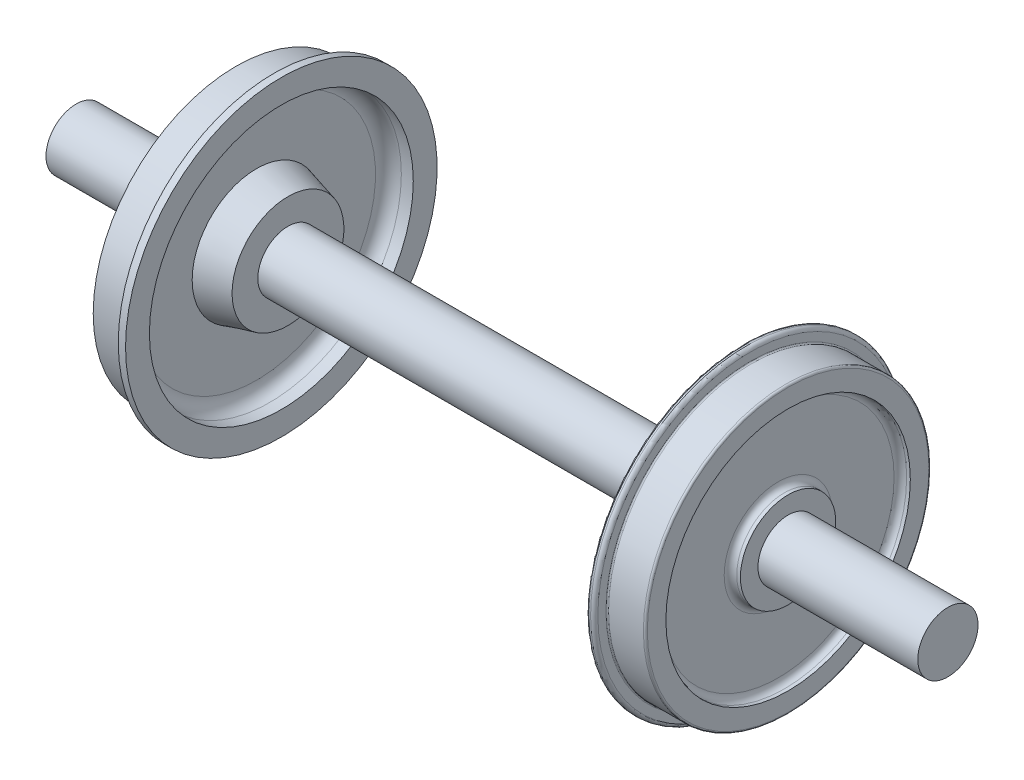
ISO-10303-21;
HEADER;
FILE_DESCRIPTION(('STEP AP214'),'2;1');
FILE_NAME('part.step','',(''),(''),'','','');
FILE_SCHEMA(('AUTOMOTIVE_DESIGN { 1 0 10303 214 1 1 1 1 }'));
ENDSEC;
DATA;
#1=APPLICATION_CONTEXT('core data for automotive mechanical design processes');
#2=APPLICATION_PROTOCOL_DEFINITION('international standard','automotive_design',2000,#1);
#3=PRODUCT_CONTEXT('',#1,'mechanical');
#4=PRODUCT('Part','Part','',(#3));
#5=PRODUCT_RELATED_PRODUCT_CATEGORY('part','',(#4));
#6=PRODUCT_DEFINITION_FORMATION('','',#4);
#7=PRODUCT_DEFINITION_CONTEXT('part definition',#1,'design');
#8=PRODUCT_DEFINITION('design','',#6,#7);
#9=PRODUCT_DEFINITION_SHAPE('','',#8);
#10=(LENGTH_UNIT() NAMED_UNIT(*) SI_UNIT(.MILLI.,.METRE.));
#11=(NAMED_UNIT(*) PLANE_ANGLE_UNIT() SI_UNIT($,.RADIAN.));
#12=(NAMED_UNIT(*) SI_UNIT($,.STERADIAN.) SOLID_ANGLE_UNIT());
#13=UNCERTAINTY_MEASURE_WITH_UNIT(LENGTH_MEASURE(1.E-05),#10,'distance_accuracy_value','');
#14=(GEOMETRIC_REPRESENTATION_CONTEXT(3) GLOBAL_UNCERTAINTY_ASSIGNED_CONTEXT((#13)) GLOBAL_UNIT_ASSIGNED_CONTEXT((#10,
#11,#12)) REPRESENTATION_CONTEXT('',''));
#15=CARTESIAN_POINT('',(0.,0.,0.));
#16=DIRECTION('',(0.,0.,1.));
#17=DIRECTION('',(1.,0.,0.));
#18=AXIS2_PLACEMENT_3D('',#15,#16,#17);
#19=CARTESIAN_POINT('',(-1316.,89.9999999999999,0.));
#20=DIRECTION('',(1.,0.,0.));
#21=DIRECTION('',(0.,0.,-1.));
#22=AXIS2_PLACEMENT_3D('',#19,#20,#21);
#23=PLANE('',#22);
#24=CARTESIAN_POINT('',(-1316.,0.,0.));
#25=DIRECTION('',(-1.,0.,0.));
#26=DIRECTION('',(0.,0.,1.));
#27=AXIS2_PLACEMENT_3D('',#24,#25,#26);
#28=CIRCLE('',#27,90.9999999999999);
#29=CARTESIAN_POINT('',(-1316.,0.,90.9999999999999));
#30=VERTEX_POINT('',#29);
#31=EDGE_CURVE('E10',#30,#30,#28,.T.);
#32=ORIENTED_EDGE('',*,*,#31,.T.);
#33=EDGE_LOOP('',(#32));
#34=FACE_BOUND('',#33,.T.);
#35=ADVANCED_FACE('F30',(#34),#23,.F.);
#36=CARTESIAN_POINT('',(0.,0.,0.));
#37=DIRECTION('',(-1.,0.,0.));
#38=DIRECTION('',(0.,0.,1.));
#39=AXIS2_PLACEMENT_3D('',#36,#37,#38);
#40=CYLINDRICAL_SURFACE('',#39,90.9999999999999);
#41=ORIENTED_EDGE('',*,*,#31,.F.);
#42=EDGE_LOOP('',(#41));
#43=FACE_BOUND('',#42,.T.);
#44=CARTESIAN_POINT('',(-833.5,0.,0.));
#45=DIRECTION('',(-1.,0.,0.));
#46=DIRECTION('',(0.,0.,1.));
#47=AXIS2_PLACEMENT_3D('',#44,#45,#46);
#48=CIRCLE('',#47,90.9999999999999);
#49=CARTESIAN_POINT('',(-833.5,0.,90.9999999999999));
#50=VERTEX_POINT('',#49);
#51=EDGE_CURVE('E37',#50,#50,#48,.T.);
#52=ORIENTED_EDGE('',*,*,#51,.T.);
#53=EDGE_LOOP('',(#52));
#54=FACE_BOUND('',#53,.T.);
#55=ADVANCED_FACE('F458',(#43,#54),#40,.T.);
#56=CARTESIAN_POINT('',(-833.5,143.,0.));
#57=DIRECTION('',(1.,0.,0.));
#58=DIRECTION('',(0.,0.,-1.));
#59=AXIS2_PLACEMENT_3D('',#56,#57,#58);
#60=PLANE('',#59);
#61=ORIENTED_EDGE('',*,*,#51,.F.);
#62=EDGE_LOOP('',(#61));
#63=FACE_BOUND('',#62,.T.);
#64=CARTESIAN_POINT('',(-833.500000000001,0.,0.));
#65=DIRECTION('',(-1.,0.,0.));
#66=DIRECTION('',(0.,0.,1.));
#67=AXIS2_PLACEMENT_3D('',#64,#65,#66);
#68=CIRCLE('',#67,144.);
#69=CARTESIAN_POINT('',(-833.500000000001,0.,144.));
#70=VERTEX_POINT('',#69);
#71=EDGE_CURVE('E41',#70,#70,#68,.T.);
#72=ORIENTED_EDGE('',*,*,#71,.T.);
#73=EDGE_LOOP('',(#72));
#74=FACE_BOUND('',#73,.T.);
#75=ADVANCED_FACE('F455',(#63,#74),#60,.F.);
#76=CARTESIAN_POINT('',(0.,0.,0.));
#77=DIRECTION('',(-1.,0.,0.));
#78=DIRECTION('',(0.,0.,1.));
#79=AXIS2_PLACEMENT_3D('',#76,#77,#78);
#80=CYLINDRICAL_SURFACE('',#79,144.);
#81=ORIENTED_EDGE('',*,*,#71,.F.);
#82=EDGE_LOOP('',(#81));
#83=FACE_BOUND('',#82,.T.);
#84=CARTESIAN_POINT('',(-803.500000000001,0.,0.));
#85=DIRECTION('',(-1.,0.,0.));
#86=DIRECTION('',(0.,0.,1.));
#87=AXIS2_PLACEMENT_3D('',#84,#85,#86);
#88=CIRCLE('',#87,144.);
#89=CARTESIAN_POINT('',(-803.500000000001,0.,144.));
#90=VERTEX_POINT('',#89);
#91=EDGE_CURVE('E45',#90,#90,#88,.T.);
#92=ORIENTED_EDGE('',*,*,#91,.T.);
#93=EDGE_LOOP('',(#92));
#94=FACE_BOUND('',#93,.T.);
#95=ADVANCED_FACE('F451',(#83,#94),#80,.T.);
#96=CARTESIAN_POINT('',(-803.500000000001,370.,0.));
#97=DIRECTION('',(1.,0.,0.));
#98=DIRECTION('',(0.,0.,-1.));
#99=AXIS2_PLACEMENT_3D('',#96,#97,#98);
#100=PLANE('',#99);
#101=ORIENTED_EDGE('',*,*,#91,.F.);
#102=EDGE_LOOP('',(#101));
#103=FACE_BOUND('',#102,.T.);
#104=CARTESIAN_POINT('',(-803.500000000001,0.,0.));
#105=DIRECTION('',(-1.,0.,0.));
#106=DIRECTION('',(0.,0.,1.));
#107=AXIS2_PLACEMENT_3D('',#104,#105,#106);
#108=CIRCLE('',#107,369.);
#109=CARTESIAN_POINT('',(-803.500000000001,0.,369.));
#110=VERTEX_POINT('',#109);
#111=EDGE_CURVE('E50',#110,#110,#108,.T.);
#112=ORIENTED_EDGE('',*,*,#111,.T.);
#113=EDGE_LOOP('',(#112));
#114=FACE_BOUND('',#113,.T.);
#115=ADVANCED_FACE('F447',(#103,#114),#100,.F.);
#116=CARTESIAN_POINT('',(0.,0.,0.));
#117=DIRECTION('',(-1.,0.,0.));
#118=DIRECTION('',(0.,0.,1.));
#119=AXIS2_PLACEMENT_3D('',#116,#117,#118);
#120=CYLINDRICAL_SURFACE('',#119,369.);
#121=ORIENTED_EDGE('',*,*,#111,.F.);
#122=EDGE_LOOP('',(#121));
#123=FACE_BOUND('',#122,.T.);
#124=CARTESIAN_POINT('',(-833.500000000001,0.,0.));
#125=DIRECTION('',(-1.,0.,0.));
#126=DIRECTION('',(0.,0.,1.));
#127=AXIS2_PLACEMENT_3D('',#124,#125,#126);
#128=CIRCLE('',#127,369.);
#129=CARTESIAN_POINT('',(-833.500000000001,0.,369.));
#130=VERTEX_POINT('',#129);
#131=EDGE_CURVE('E53',#130,#130,#128,.T.);
#132=ORIENTED_EDGE('',*,*,#131,.T.);
#133=EDGE_LOOP('',(#132));
#134=FACE_BOUND('',#133,.T.);
#135=ADVANCED_FACE('F443',(#123,#134),#120,.F.);
#136=CARTESIAN_POINT('',(-833.500000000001,430.,0.));
#137=DIRECTION('',(1.,0.,0.));
#138=DIRECTION('',(0.,0.,-1.));
#139=AXIS2_PLACEMENT_3D('',#136,#137,#138);
#140=PLANE('',#139);
#141=ORIENTED_EDGE('',*,*,#131,.F.);
#142=EDGE_LOOP('',(#141));
#143=FACE_BOUND('',#142,.T.);
#144=CARTESIAN_POINT('',(-833.500000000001,0.,0.));
#145=DIRECTION('',(-1.,0.,0.));
#146=DIRECTION('',(0.,0.,1.));
#147=AXIS2_PLACEMENT_3D('',#144,#145,#146);
#148=CIRCLE('',#147,431.);
#149=CARTESIAN_POINT('',(-833.500000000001,0.,431.));
#150=VERTEX_POINT('',#149);
#151=EDGE_CURVE('E56',#150,#150,#148,.T.);
#152=ORIENTED_EDGE('',*,*,#151,.T.);
#153=EDGE_LOOP('',(#152));
#154=FACE_BOUND('',#153,.T.);
#155=ADVANCED_FACE('F439',(#143,#154),#140,.F.);
#156=CARTESIAN_POINT('',(0.,0.,0.));
#157=DIRECTION('',(-1.,0.,0.));
#158=DIRECTION('',(0.,0.,1.));
#159=AXIS2_PLACEMENT_3D('',#156,#157,#158);
#160=CYLINDRICAL_SURFACE('',#159,431.);
#161=ORIENTED_EDGE('',*,*,#151,.F.);
#162=EDGE_LOOP('',(#161));
#163=FACE_BOUND('',#162,.T.);
#164=CARTESIAN_POINT('',(-718.5,0.,0.));
#165=DIRECTION('',(-1.,0.,0.));
#166=DIRECTION('',(0.,0.,1.));
#167=AXIS2_PLACEMENT_3D('',#164,#165,#166);
#168=CIRCLE('',#167,431.);
#169=CARTESIAN_POINT('',(-718.5,0.,431.));
#170=VERTEX_POINT('',#169);
#171=EDGE_CURVE('E59',#170,#170,#168,.T.);
#172=ORIENTED_EDGE('',*,*,#171,.T.);
#173=EDGE_LOOP('',(#172));
#174=FACE_BOUND('',#173,.T.);
#175=ADVANCED_FACE('F435',(#163,#174),#160,.T.);
#176=CARTESIAN_POINT('',(-718.5,469.37867092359,0.));
#177=DIRECTION('',(1.,0.,0.));
#178=DIRECTION('',(0.,0.,-1.));
#179=AXIS2_PLACEMENT_3D('',#176,#177,#178);
#180=PLANE('',#179);
#181=ORIENTED_EDGE('',*,*,#171,.F.);
#182=EDGE_LOOP('',(#181));
#183=FACE_BOUND('',#182,.T.);
#184=CARTESIAN_POINT('',(-718.5,0.,0.));
#185=DIRECTION('',(-1.,0.,0.));
#186=DIRECTION('',(0.,0.,1.));
#187=AXIS2_PLACEMENT_3D('',#184,#185,#186);
#188=CIRCLE('',#187,470.37867092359);
#189=CARTESIAN_POINT('',(-718.5,0.,470.37867092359));
#190=VERTEX_POINT('',#189);
#191=EDGE_CURVE('E62',#190,#190,#188,.T.);
#192=ORIENTED_EDGE('',*,*,#191,.T.);
#193=EDGE_LOOP('',(#192));
#194=FACE_BOUND('',#193,.T.);
#195=ADVANCED_FACE('F431',(#183,#194),#180,.F.);
#196=CARTESIAN_POINT('',(0.,0.,0.));
#197=DIRECTION('',(-1.,0.,0.));
#198=DIRECTION('',(0.,0.,1.));
#199=AXIS2_PLACEMENT_3D('',#196,#197,#198);
#200=CYLINDRICAL_SURFACE('',#199,470.37867092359);
#201=ORIENTED_EDGE('',*,*,#191,.F.);
#202=EDGE_LOOP('',(#201));
#203=FACE_BOUND('',#202,.T.);
#204=CARTESIAN_POINT('',(-696.5,0.,0.));
#205=DIRECTION('',(-1.,0.,0.));
#206=DIRECTION('',(0.,0.,1.));
#207=AXIS2_PLACEMENT_3D('',#204,#205,#206);
#208=CIRCLE('',#207,470.37867092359);
#209=CARTESIAN_POINT('',(-696.5,0.,470.37867092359));
#210=VERTEX_POINT('',#209);
#211=EDGE_CURVE('E65',#210,#210,#208,.T.);
#212=ORIENTED_EDGE('',*,*,#211,.T.);
#213=EDGE_LOOP('',(#212));
#214=FACE_BOUND('',#213,.T.);
#215=ADVANCED_FACE('F427',(#203,#214),#200,.T.);
#216=CARTESIAN_POINT('',(-696.5,399.37867092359,0.));
#217=DIRECTION('',(-1.,0.,0.));
#218=DIRECTION('',(0.,0.,1.));
#219=AXIS2_PLACEMENT_3D('',#216,#217,#218);
#220=PLANE('',#219);
#221=ORIENTED_EDGE('',*,*,#211,.F.);
#222=EDGE_LOOP('',(#221));
#223=FACE_BOUND('',#222,.T.);
#224=CARTESIAN_POINT('',(-696.5,0.,0.));
#225=DIRECTION('',(-1.,0.,0.));
#226=DIRECTION('',(0.,0.,1.));
#227=AXIS2_PLACEMENT_3D('',#224,#225,#226);
#228=CIRCLE('',#227,398.37867092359);
#229=CARTESIAN_POINT('',(-696.5,0.,398.37867092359));
#230=VERTEX_POINT('',#229);
#231=EDGE_CURVE('E68',#230,#230,#228,.T.);
#232=ORIENTED_EDGE('',*,*,#231,.T.);
#233=EDGE_LOOP('',(#232));
#234=FACE_BOUND('',#233,.T.);
#235=ADVANCED_FACE('F423',(#223,#234),#220,.F.);
#236=CARTESIAN_POINT('',(0.,0.,0.));
#237=DIRECTION('',(-1.,0.,0.));
#238=DIRECTION('',(0.,0.,1.));
#239=AXIS2_PLACEMENT_3D('',#236,#237,#238);
#240=CYLINDRICAL_SURFACE('',#239,398.37867092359);
#241=ORIENTED_EDGE('',*,*,#231,.F.);
#242=EDGE_LOOP('',(#241));
#243=FACE_BOUND('',#242,.T.);
#244=CARTESIAN_POINT('',(-732.5,0.,0.));
#245=DIRECTION('',(-1.,0.,0.));
#246=DIRECTION('',(0.,0.,1.));
#247=AXIS2_PLACEMENT_3D('',#244,#245,#246);
#248=CIRCLE('',#247,398.37867092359);
#249=CARTESIAN_POINT('',(-732.5,0.,398.37867092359));
#250=VERTEX_POINT('',#249);
#251=EDGE_CURVE('E71',#250,#250,#248,.T.);
#252=ORIENTED_EDGE('',*,*,#251,.T.);
#253=EDGE_LOOP('',(#252));
#254=FACE_BOUND('',#253,.T.);
#255=ADVANCED_FACE('F419',(#243,#254),#240,.F.);
#256=CARTESIAN_POINT('',(-732.5,0.,0.));
#257=DIRECTION('',(-1.,0.,0.));
#258=DIRECTION('',(0.,0.,1.));
#259=AXIS2_PLACEMENT_3D('',#256,#257,#258);
#260=TOROIDAL_SURFACE('',#259,359.37867092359,39.);
#261=ORIENTED_EDGE('',*,*,#251,.F.);
#262=EDGE_LOOP('',(#261));
#263=FACE_BOUND('',#262,.T.);
#264=CARTESIAN_POINT('',(-771.5,0.,0.));
#265=DIRECTION('',(-1.,0.,0.));
#266=DIRECTION('',(0.,0.,1.));
#267=AXIS2_PLACEMENT_3D('',#264,#265,#266);
#268=CIRCLE('',#267,359.37867092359);
#269=CARTESIAN_POINT('',(-771.5,0.,359.37867092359));
#270=VERTEX_POINT('',#269);
#271=EDGE_CURVE('E74',#270,#270,#268,.T.);
#272=ORIENTED_EDGE('',*,*,#271,.T.);
#273=EDGE_LOOP('',(#272));
#274=FACE_BOUND('',#273,.T.);
#275=ADVANCED_FACE('F415',(#263,#274),#260,.F.);
#276=CARTESIAN_POINT('',(-771.5,193.455173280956,0.));
#277=DIRECTION('',(-1.,0.,0.));
#278=DIRECTION('',(0.,0.,1.));
#279=AXIS2_PLACEMENT_3D('',#276,#277,#278);
#280=PLANE('',#279);
#281=ORIENTED_EDGE('',*,*,#271,.F.);
#282=EDGE_LOOP('',(#281));
#283=FACE_BOUND('',#282,.T.);
#284=CARTESIAN_POINT('',(-771.5,0.,0.));
#285=DIRECTION('',(-1.,0.,0.));
#286=DIRECTION('',(0.,0.,1.));
#287=AXIS2_PLACEMENT_3D('',#284,#285,#286);
#288=CIRCLE('',#287,194.222500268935);
#289=CARTESIAN_POINT('',(-771.5,0.,194.222500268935));
#290=VERTEX_POINT('',#289);
#291=EDGE_CURVE('E77',#290,#290,#288,.T.);
#292=ORIENTED_EDGE('',*,*,#291,.T.);
#293=EDGE_LOOP('',(#292));
#294=FACE_BOUND('',#293,.T.);
#295=ADVANCED_FACE('F411',(#283,#294),#280,.F.);
#296=CARTESIAN_POINT('',(-676.5,0.,0.));
#297=DIRECTION('',(-1.,0.,0.));
#298=DIRECTION('',(0.,0.,1.));
#299=AXIS2_PLACEMENT_3D('',#296,#297,#298);
#300=CONICAL_SURFACE('',#299,168.767326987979,0.261799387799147);
#301=ORIENTED_EDGE('',*,*,#291,.F.);
#302=EDGE_LOOP('',(#301));
#303=FACE_BOUND('',#302,.T.);
#304=CARTESIAN_POINT('',(-676.5,0.,0.));
#305=DIRECTION('',(-1.,0.,0.));
#306=DIRECTION('',(0.,0.,1.));
#307=AXIS2_PLACEMENT_3D('',#304,#305,#306);
#308=CIRCLE('',#307,168.767326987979);
#309=CARTESIAN_POINT('',(-676.5,0.,168.767326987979));
#310=VERTEX_POINT('',#309);
#311=EDGE_CURVE('E80',#310,#310,#308,.T.);
#312=ORIENTED_EDGE('',*,*,#311,.T.);
#313=EDGE_LOOP('',(#312));
#314=FACE_BOUND('',#313,.T.);
#315=ADVANCED_FACE('F407',(#303,#314),#300,.T.);
#316=CARTESIAN_POINT('',(-676.5,89.9999999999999,0.));
#317=DIRECTION('',(-1.,0.,0.));
#318=DIRECTION('',(0.,0.,1.));
#319=AXIS2_PLACEMENT_3D('',#316,#317,#318);
#320=PLANE('',#319);
#321=ORIENTED_EDGE('',*,*,#311,.F.);
#322=EDGE_LOOP('',(#321));
#323=FACE_BOUND('',#322,.T.);
#324=CARTESIAN_POINT('',(-676.5,0.,0.));
#325=DIRECTION('',(-1.,0.,0.));
#326=DIRECTION('',(0.,0.,1.));
#327=AXIS2_PLACEMENT_3D('',#324,#325,#326);
#328=CIRCLE('',#327,90.9999999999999);
#329=CARTESIAN_POINT('',(-676.5,0.,90.9999999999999));
#330=VERTEX_POINT('',#329);
#331=EDGE_CURVE('E83',#330,#330,#328,.T.);
#332=ORIENTED_EDGE('',*,*,#331,.T.);
#333=EDGE_LOOP('',(#332));
#334=FACE_BOUND('',#333,.T.);
#335=ADVANCED_FACE('F403',(#323,#334),#320,.F.);
#336=CARTESIAN_POINT('',(0.,0.,0.));
#337=DIRECTION('',(-1.,0.,0.));
#338=DIRECTION('',(0.,0.,1.));
#339=AXIS2_PLACEMENT_3D('',#336,#337,#338);
#340=CYLINDRICAL_SURFACE('',#339,91.);
#341=ORIENTED_EDGE('',*,*,#331,.F.);
#342=EDGE_LOOP('',(#341));
#343=FACE_BOUND('',#342,.T.);
#344=CARTESIAN_POINT('',(676.5,0.,0.));
#345=DIRECTION('',(-1.,0.,0.));
#346=DIRECTION('',(0.,0.,1.));
#347=AXIS2_PLACEMENT_3D('',#344,#345,#346);
#348=CIRCLE('',#347,91.);
#349=CARTESIAN_POINT('',(676.5,0.,91.));
#350=VERTEX_POINT('',#349);
#351=EDGE_CURVE('E86',#350,#350,#348,.T.);
#352=ORIENTED_EDGE('',*,*,#351,.T.);
#353=EDGE_LOOP('',(#352));
#354=FACE_BOUND('',#353,.T.);
#355=ADVANCED_FACE('F399',(#343,#354),#340,.T.);
#356=CARTESIAN_POINT('',(676.5,90.,0.));
#357=DIRECTION('',(1.,0.,0.));
#358=DIRECTION('',(0.,0.,-1.));
#359=AXIS2_PLACEMENT_3D('',#356,#357,#358);
#360=PLANE('',#359);
#361=ORIENTED_EDGE('',*,*,#351,.F.);
#362=EDGE_LOOP('',(#361));
#363=FACE_BOUND('',#362,.T.);
#364=CARTESIAN_POINT('',(676.5,0.,0.));
#365=DIRECTION('',(-1.,0.,0.));
#366=DIRECTION('',(0.,0.,1.));
#367=AXIS2_PLACEMENT_3D('',#364,#365,#366);
#368=CIRCLE('',#367,168.767326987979);
#369=CARTESIAN_POINT('',(676.5,0.,168.767326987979));
#370=VERTEX_POINT('',#369);
#371=EDGE_CURVE('E89',#370,#370,#368,.T.);
#372=ORIENTED_EDGE('',*,*,#371,.T.);
#373=EDGE_LOOP('',(#372));
#374=FACE_BOUND('',#373,.T.);
#375=ADVANCED_FACE('F395',(#363,#374),#360,.F.);
#376=CARTESIAN_POINT('',(757.417561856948,0.,0.));
#377=DIRECTION('',(1.,0.,0.));
#378=DIRECTION('',(0.,0.,-1.));
#379=AXIS2_PLACEMENT_3D('',#376,#377,#378);
#380=CONICAL_SURFACE('',#379,190.449122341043,0.261799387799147);
#381=ORIENTED_EDGE('',*,*,#371,.F.);
#382=EDGE_LOOP('',(#381));
#383=FACE_BOUND('',#382,.T.);
#384=CARTESIAN_POINT('',(757.417561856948,0.,0.));
#385=DIRECTION('',(-1.,0.,0.));
#386=DIRECTION('',(0.,0.,1.));
#387=AXIS2_PLACEMENT_3D('',#384,#385,#386);
#388=CIRCLE('',#387,190.449122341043);
#389=CARTESIAN_POINT('',(757.417561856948,0.,190.449122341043));
#390=VERTEX_POINT('',#389);
#391=EDGE_CURVE('E92',#390,#390,#388,.T.);
#392=ORIENTED_EDGE('',*,*,#391,.T.);
#393=EDGE_LOOP('',(#392));
#394=FACE_BOUND('',#393,.T.);
#395=ADVANCED_FACE('F391',(#383,#394),#380,.T.);
#396=CARTESIAN_POINT('',(752.5,0.,0.));
#397=DIRECTION('',(-1.,0.,0.));
#398=DIRECTION('',(0.,0.,1.));
#399=AXIS2_PLACEMENT_3D('',#396,#397,#398);
#400=TOROIDAL_SURFACE('',#399,208.801713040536,19.);
#401=ORIENTED_EDGE('',*,*,#391,.F.);
#402=EDGE_LOOP('',(#401));
#403=FACE_BOUND('',#402,.T.);
#404=CARTESIAN_POINT('',(771.5,0.,0.));
#405=DIRECTION('',(-1.,0.,0.));
#406=DIRECTION('',(0.,0.,1.));
#407=AXIS2_PLACEMENT_3D('',#404,#405,#406);
#408=CIRCLE('',#407,208.801713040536);
#409=CARTESIAN_POINT('',(771.5,0.,208.801713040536));
#410=VERTEX_POINT('',#409);
#411=EDGE_CURVE('E95',#410,#410,#408,.T.);
#412=ORIENTED_EDGE('',*,*,#411,.T.);
#413=EDGE_LOOP('',(#412));
#414=FACE_BOUND('',#413,.T.);
#415=ADVANCED_FACE('F387',(#403,#414),#400,.F.);
#416=CARTESIAN_POINT('',(771.5,208.801713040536,0.));
#417=DIRECTION('',(1.,0.,0.));
#418=DIRECTION('',(0.,0.,-1.));
#419=AXIS2_PLACEMENT_3D('',#416,#417,#418);
#420=PLANE('',#419);
#421=ORIENTED_EDGE('',*,*,#411,.F.);
#422=EDGE_LOOP('',(#421));
#423=FACE_BOUND('',#422,.T.);
#424=CARTESIAN_POINT('',(771.5,0.,0.));
#425=DIRECTION('',(-1.,0.,0.));
#426=DIRECTION('',(0.,0.,1.));
#427=AXIS2_PLACEMENT_3D('',#424,#425,#426);
#428=CIRCLE('',#427,359.37867092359);
#429=CARTESIAN_POINT('',(771.5,0.,359.37867092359));
#430=VERTEX_POINT('',#429);
#431=EDGE_CURVE('E98',#430,#430,#428,.T.);
#432=ORIENTED_EDGE('',*,*,#431,.T.);
#433=EDGE_LOOP('',(#432));
#434=FACE_BOUND('',#433,.T.);
#435=ADVANCED_FACE('F383',(#423,#434),#420,.F.);
#436=CARTESIAN_POINT('',(732.5,0.,0.));
#437=DIRECTION('',(-1.,0.,0.));
#438=DIRECTION('',(0.,0.,1.));
#439=AXIS2_PLACEMENT_3D('',#436,#437,#438);
#440=TOROIDAL_SURFACE('',#439,359.37867092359,39.);
#441=ORIENTED_EDGE('',*,*,#431,.F.);
#442=EDGE_LOOP('',(#441));
#443=FACE_BOUND('',#442,.T.);
#444=CARTESIAN_POINT('',(732.5,0.,0.));
#445=DIRECTION('',(-1.,0.,0.));
#446=DIRECTION('',(0.,0.,1.));
#447=AXIS2_PLACEMENT_3D('',#444,#445,#446);
#448=CIRCLE('',#447,398.37867092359);
#449=CARTESIAN_POINT('',(732.5,0.,398.37867092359));
#450=VERTEX_POINT('',#449);
#451=EDGE_CURVE('E101',#450,#450,#448,.T.);
#452=ORIENTED_EDGE('',*,*,#451,.T.);
#453=EDGE_LOOP('',(#452));
#454=FACE_BOUND('',#453,.T.);
#455=ADVANCED_FACE('F379',(#443,#454),#440,.F.);
#456=CARTESIAN_POINT('',(0.,0.,0.));
#457=DIRECTION('',(-1.,0.,0.));
#458=DIRECTION('',(0.,0.,1.));
#459=AXIS2_PLACEMENT_3D('',#456,#457,#458);
#460=CYLINDRICAL_SURFACE('',#459,398.37867092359);
#461=ORIENTED_EDGE('',*,*,#451,.F.);
#462=EDGE_LOOP('',(#461));
#463=FACE_BOUND('',#462,.T.);
#464=CARTESIAN_POINT('',(702.5,0.,0.));
#465=DIRECTION('',(-1.,0.,0.));
#466=DIRECTION('',(0.,0.,1.));
#467=AXIS2_PLACEMENT_3D('',#464,#465,#466);
#468=CIRCLE('',#467,398.37867092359);
#469=CARTESIAN_POINT('',(702.5,0.,398.37867092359));
#470=VERTEX_POINT('',#469);
#471=EDGE_CURVE('E104',#470,#470,#468,.T.);
#472=ORIENTED_EDGE('',*,*,#471,.T.);
#473=EDGE_LOOP('',(#472));
#474=FACE_BOUND('',#473,.T.);
#475=ADVANCED_FACE('F375',(#463,#474),#460,.F.);
#476=CARTESIAN_POINT('',(702.5,0.,0.));
#477=DIRECTION('',(-1.,0.,0.));
#478=DIRECTION('',(0.,0.,1.));
#479=AXIS2_PLACEMENT_3D('',#476,#477,#478);
#480=TOROIDAL_SURFACE('',#479,404.37867092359,5.99999999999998);
#481=ORIENTED_EDGE('',*,*,#471,.F.);
#482=EDGE_LOOP('',(#481));
#483=FACE_BOUND('',#482,.T.);
#484=CARTESIAN_POINT('',(696.5,0.,0.));
#485=DIRECTION('',(-1.,0.,0.));
#486=DIRECTION('',(0.,0.,1.));
#487=AXIS2_PLACEMENT_3D('',#484,#485,#486);
#488=CIRCLE('',#487,404.37867092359);
#489=CARTESIAN_POINT('',(696.5,0.,404.37867092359));
#490=VERTEX_POINT('',#489);
#491=EDGE_CURVE('E107',#490,#490,#488,.T.);
#492=ORIENTED_EDGE('',*,*,#491,.T.);
#493=EDGE_LOOP('',(#492));
#494=FACE_BOUND('',#493,.T.);
#495=ADVANCED_FACE('F371',(#483,#494),#480,.T.);
#496=CARTESIAN_POINT('',(696.5,404.37867092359,0.));
#497=DIRECTION('',(1.,0.,0.));
#498=DIRECTION('',(0.,0.,-1.));
#499=AXIS2_PLACEMENT_3D('',#496,#497,#498);
#500=PLANE('',#499);
#501=ORIENTED_EDGE('',*,*,#491,.F.);
#502=EDGE_LOOP('',(#501));
#503=FACE_BOUND('',#502,.T.);
#504=CARTESIAN_POINT('',(696.5,0.,0.));
#505=DIRECTION('',(-1.,0.,0.));
#506=DIRECTION('',(0.,0.,1.));
#507=AXIS2_PLACEMENT_3D('',#504,#505,#506);
#508=CIRCLE('',#507,464.37867092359);
#509=CARTESIAN_POINT('',(696.5,0.,464.37867092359));
#510=VERTEX_POINT('',#509);
#511=EDGE_CURVE('E110',#510,#510,#508,.T.);
#512=ORIENTED_EDGE('',*,*,#511,.T.);
#513=EDGE_LOOP('',(#512));
#514=FACE_BOUND('',#513,.T.);
#515=ADVANCED_FACE('F367',(#503,#514),#500,.F.);
#516=CARTESIAN_POINT('',(702.5,0.,0.));
#517=DIRECTION('',(-1.,0.,0.));
#518=DIRECTION('',(0.,0.,1.));
#519=AXIS2_PLACEMENT_3D('',#516,#517,#518);
#520=TOROIDAL_SURFACE('',#519,464.37867092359,6.);
#521=ORIENTED_EDGE('',*,*,#511,.F.);
#522=EDGE_LOOP('',(#521));
#523=FACE_BOUND('',#522,.T.);
#524=CARTESIAN_POINT('',(702.5,0.,0.));
#525=DIRECTION('',(-1.,0.,0.));
#526=DIRECTION('',(0.,0.,1.));
#527=AXIS2_PLACEMENT_3D('',#524,#525,#526);
#528=CIRCLE('',#527,470.37867092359);
#529=CARTESIAN_POINT('',(702.5,0.,470.37867092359));
#530=VERTEX_POINT('',#529);
#531=EDGE_CURVE('E113',#530,#530,#528,.T.);
#532=ORIENTED_EDGE('',*,*,#531,.T.);
#533=EDGE_LOOP('',(#532));
#534=FACE_BOUND('',#533,.T.);
#535=ADVANCED_FACE('F363',(#523,#534),#520,.T.);
#536=CARTESIAN_POINT('',(0.,0.,0.));
#537=DIRECTION('',(-1.,0.,0.));
#538=DIRECTION('',(0.,0.,1.));
#539=AXIS2_PLACEMENT_3D('',#536,#537,#538);
#540=CYLINDRICAL_SURFACE('',#539,470.37867092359);
#541=ORIENTED_EDGE('',*,*,#531,.F.);
#542=EDGE_LOOP('',(#541));
#543=FACE_BOUND('',#542,.T.);
#544=CARTESIAN_POINT('',(707.5,0.,0.));
#545=DIRECTION('',(-1.,0.,0.));
#546=DIRECTION('',(0.,0.,1.));
#547=AXIS2_PLACEMENT_3D('',#544,#545,#546);
#548=CIRCLE('',#547,470.37867092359);
#549=CARTESIAN_POINT('',(707.5,0.,470.37867092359));
#550=VERTEX_POINT('',#549);
#551=EDGE_CURVE('E116',#550,#550,#548,.T.);
#552=ORIENTED_EDGE('',*,*,#551,.T.);
#553=EDGE_LOOP('',(#552));
#554=FACE_BOUND('',#553,.T.);
#555=ADVANCED_FACE('F359',(#543,#554),#540,.T.);
#556=CARTESIAN_POINT('',(707.5,0.,0.));
#557=DIRECTION('',(-1.,0.,0.));
#558=DIRECTION('',(0.,0.,1.));
#559=AXIS2_PLACEMENT_3D('',#556,#557,#558);
#560=TOROIDAL_SURFACE('',#559,459.37867092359,11.);
#561=ORIENTED_EDGE('',*,*,#551,.F.);
#562=EDGE_LOOP('',(#561));
#563=FACE_BOUND('',#562,.T.);
#564=CARTESIAN_POINT('',(718.5,0.,0.));
#565=DIRECTION('',(-1.,0.,0.));
#566=DIRECTION('',(0.,0.,1.));
#567=AXIS2_PLACEMENT_3D('',#564,#565,#566);
#568=CIRCLE('',#567,459.37867092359);
#569=CARTESIAN_POINT('',(718.5,0.,459.37867092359));
#570=VERTEX_POINT('',#569);
#571=EDGE_CURVE('E119',#570,#570,#568,.T.);
#572=ORIENTED_EDGE('',*,*,#571,.T.);
#573=EDGE_LOOP('',(#572));
#574=FACE_BOUND('',#573,.T.);
#575=ADVANCED_FACE('F355',(#563,#574),#560,.T.);
#576=CARTESIAN_POINT('',(718.5,459.37867092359,0.));
#577=DIRECTION('',(-1.,0.,0.));
#578=DIRECTION('',(0.,0.,1.));
#579=AXIS2_PLACEMENT_3D('',#576,#577,#578);
#580=PLANE('',#579);
#581=ORIENTED_EDGE('',*,*,#571,.F.);
#582=EDGE_LOOP('',(#581));
#583=FACE_BOUND('',#582,.T.);
#584=CARTESIAN_POINT('',(718.5,0.,0.));
#585=DIRECTION('',(-1.,0.,0.));
#586=DIRECTION('',(0.,0.,1.));
#587=AXIS2_PLACEMENT_3D('',#584,#585,#586);
#588=CIRCLE('',#587,435.);
#589=CARTESIAN_POINT('',(718.5,0.,435.));
#590=VERTEX_POINT('',#589);
#591=EDGE_CURVE('E122',#590,#590,#588,.T.);
#592=ORIENTED_EDGE('',*,*,#591,.T.);
#593=EDGE_LOOP('',(#592));
#594=FACE_BOUND('',#593,.T.);
#595=ADVANCED_FACE('F351',(#583,#594),#580,.F.);
#596=CARTESIAN_POINT('',(722.5,0.,0.));
#597=DIRECTION('',(-1.,0.,0.));
#598=DIRECTION('',(0.,0.,1.));
#599=AXIS2_PLACEMENT_3D('',#596,#597,#598);
#600=TOROIDAL_SURFACE('',#599,435.,3.99999999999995);
#601=ORIENTED_EDGE('',*,*,#591,.F.);
#602=EDGE_LOOP('',(#601));
#603=FACE_BOUND('',#602,.T.);
#604=CARTESIAN_POINT('',(722.5,0.,0.));
#605=DIRECTION('',(-1.,0.,0.));
#606=DIRECTION('',(0.,0.,1.));
#607=AXIS2_PLACEMENT_3D('',#604,#605,#606);
#608=CIRCLE('',#607,431.);
#609=CARTESIAN_POINT('',(722.5,0.,431.));
#610=VERTEX_POINT('',#609);
#611=EDGE_CURVE('E125',#610,#610,#608,.T.);
#612=ORIENTED_EDGE('',*,*,#611,.T.);
#613=EDGE_LOOP('',(#612));
#614=FACE_BOUND('',#613,.T.);
#615=ADVANCED_FACE('F347',(#603,#614),#600,.F.);
#616=CARTESIAN_POINT('',(0.,0.,0.));
#617=DIRECTION('',(-1.,0.,0.));
#618=DIRECTION('',(0.,0.,1.));
#619=AXIS2_PLACEMENT_3D('',#616,#617,#618);
#620=CYLINDRICAL_SURFACE('',#619,431.);
#621=ORIENTED_EDGE('',*,*,#611,.F.);
#622=EDGE_LOOP('',(#621));
#623=FACE_BOUND('',#622,.T.);
#624=CARTESIAN_POINT('',(827.500000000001,0.,0.));
#625=DIRECTION('',(-1.,0.,0.));
#626=DIRECTION('',(0.,0.,1.));
#627=AXIS2_PLACEMENT_3D('',#624,#625,#626);
#628=CIRCLE('',#627,431.);
#629=CARTESIAN_POINT('',(827.500000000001,0.,431.));
#630=VERTEX_POINT('',#629);
#631=EDGE_CURVE('E128',#630,#630,#628,.T.);
#632=ORIENTED_EDGE('',*,*,#631,.T.);
#633=EDGE_LOOP('',(#632));
#634=FACE_BOUND('',#633,.T.);
#635=ADVANCED_FACE('F343',(#623,#634),#620,.T.);
#636=CARTESIAN_POINT('',(827.500000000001,0.,0.));
#637=DIRECTION('',(-1.,0.,0.));
#638=DIRECTION('',(0.,0.,1.));
#639=AXIS2_PLACEMENT_3D('',#636,#637,#638);
#640=TOROIDAL_SURFACE('',#639,425.,5.99999999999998);
#641=ORIENTED_EDGE('',*,*,#631,.F.);
#642=EDGE_LOOP('',(#641));
#643=FACE_BOUND('',#642,.T.);
#644=CARTESIAN_POINT('',(833.500000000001,0.,0.));
#645=DIRECTION('',(-1.,0.,0.));
#646=DIRECTION('',(0.,0.,1.));
#647=AXIS2_PLACEMENT_3D('',#644,#645,#646);
#648=CIRCLE('',#647,425.);
#649=CARTESIAN_POINT('',(833.500000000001,0.,425.));
#650=VERTEX_POINT('',#649);
#651=EDGE_CURVE('E131',#650,#650,#648,.T.);
#652=ORIENTED_EDGE('',*,*,#651,.T.);
#653=EDGE_LOOP('',(#652));
#654=FACE_BOUND('',#653,.T.);
#655=ADVANCED_FACE('F339',(#643,#654),#640,.T.);
#656=CARTESIAN_POINT('',(833.500000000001,425.,0.));
#657=DIRECTION('',(-1.,0.,0.));
#658=DIRECTION('',(0.,0.,1.));
#659=AXIS2_PLACEMENT_3D('',#656,#657,#658);
#660=PLANE('',#659);
#661=ORIENTED_EDGE('',*,*,#651,.F.);
#662=EDGE_LOOP('',(#661));
#663=FACE_BOUND('',#662,.T.);
#664=CARTESIAN_POINT('',(833.500000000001,0.,0.));
#665=DIRECTION('',(-1.,0.,0.));
#666=DIRECTION('',(0.,0.,1.));
#667=AXIS2_PLACEMENT_3D('',#664,#665,#666);
#668=CIRCLE('',#667,369.);
#669=CARTESIAN_POINT('',(833.500000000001,0.,369.));
#670=VERTEX_POINT('',#669);
#671=EDGE_CURVE('E134',#670,#670,#668,.T.);
#672=ORIENTED_EDGE('',*,*,#671,.T.);
#673=EDGE_LOOP('',(#672));
#674=FACE_BOUND('',#673,.T.);
#675=ADVANCED_FACE('F335',(#663,#674),#660,.F.);
#676=CARTESIAN_POINT('',(0.,0.,0.));
#677=DIRECTION('',(-1.,0.,0.));
#678=DIRECTION('',(0.,0.,1.));
#679=AXIS2_PLACEMENT_3D('',#676,#677,#678);
#680=CYLINDRICAL_SURFACE('',#679,369.);
#681=ORIENTED_EDGE('',*,*,#671,.F.);
#682=EDGE_LOOP('',(#681));
#683=FACE_BOUND('',#682,.T.);
#684=CARTESIAN_POINT('',(822.500000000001,0.,0.));
#685=DIRECTION('',(-1.,0.,0.));
#686=DIRECTION('',(0.,0.,1.));
#687=AXIS2_PLACEMENT_3D('',#684,#685,#686);
#688=CIRCLE('',#687,369.);
#689=CARTESIAN_POINT('',(822.500000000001,0.,369.));
#690=VERTEX_POINT('',#689);
#691=EDGE_CURVE('E137',#690,#690,#688,.T.);
#692=ORIENTED_EDGE('',*,*,#691,.T.);
#693=EDGE_LOOP('',(#692));
#694=FACE_BOUND('',#693,.T.);
#695=ADVANCED_FACE('F331',(#683,#694),#680,.F.);
#696=CARTESIAN_POINT('',(822.500000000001,0.,0.));
#697=DIRECTION('',(-1.,0.,0.));
#698=DIRECTION('',(0.,0.,1.));
#699=AXIS2_PLACEMENT_3D('',#696,#697,#698);
#700=TOROIDAL_SURFACE('',#699,350.,18.9999999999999);
#701=ORIENTED_EDGE('',*,*,#691,.F.);
#702=EDGE_LOOP('',(#701));
#703=FACE_BOUND('',#702,.T.);
#704=CARTESIAN_POINT('',(803.500000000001,0.,0.));
#705=DIRECTION('',(-1.,0.,0.));
#706=DIRECTION('',(0.,0.,1.));
#707=AXIS2_PLACEMENT_3D('',#704,#705,#706);
#708=CIRCLE('',#707,350.);
#709=CARTESIAN_POINT('',(803.500000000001,0.,350.));
#710=VERTEX_POINT('',#709);
#711=EDGE_CURVE('E140',#710,#710,#708,.T.);
#712=ORIENTED_EDGE('',*,*,#711,.T.);
#713=EDGE_LOOP('',(#712));
#714=FACE_BOUND('',#713,.T.);
#715=ADVANCED_FACE('F327',(#703,#714),#700,.F.);
#716=CARTESIAN_POINT('',(803.500000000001,350.,0.));
#717=DIRECTION('',(-1.,0.,0.));
#718=DIRECTION('',(0.,0.,1.));
#719=AXIS2_PLACEMENT_3D('',#716,#717,#718);
#720=PLANE('',#719);
#721=ORIENTED_EDGE('',*,*,#711,.F.);
#722=EDGE_LOOP('',(#721));
#723=FACE_BOUND('',#722,.T.);
#724=CARTESIAN_POINT('',(803.500000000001,0.,0.));
#725=DIRECTION('',(-1.,0.,0.));
#726=DIRECTION('',(0.,0.,1.));
#727=AXIS2_PLACEMENT_3D('',#724,#725,#726);
#728=CIRCLE('',#727,163.);
#729=CARTESIAN_POINT('',(803.500000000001,0.,163.));
#730=VERTEX_POINT('',#729);
#731=EDGE_CURVE('E143',#730,#730,#728,.T.);
#732=ORIENTED_EDGE('',*,*,#731,.T.);
#733=EDGE_LOOP('',(#732));
#734=FACE_BOUND('',#733,.T.);
#735=ADVANCED_FACE('F323',(#723,#734),#720,.F.);
#736=CARTESIAN_POINT('',(822.500000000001,0.,0.));
#737=DIRECTION('',(-1.,0.,0.));
#738=DIRECTION('',(0.,0.,1.));
#739=AXIS2_PLACEMENT_3D('',#736,#737,#738);
#740=TOROIDAL_SURFACE('',#739,163.,19.0000000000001);
#741=ORIENTED_EDGE('',*,*,#731,.F.);
#742=EDGE_LOOP('',(#741));
#743=FACE_BOUND('',#742,.T.);
#744=CARTESIAN_POINT('',(822.500000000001,0.,0.));
#745=DIRECTION('',(-1.,0.,0.));
#746=DIRECTION('',(0.,0.,1.));
#747=AXIS2_PLACEMENT_3D('',#744,#745,#746);
#748=CIRCLE('',#747,144.);
#749=CARTESIAN_POINT('',(822.500000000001,0.,144.));
#750=VERTEX_POINT('',#749);
#751=EDGE_CURVE('E146',#750,#750,#748,.T.);
#752=ORIENTED_EDGE('',*,*,#751,.T.);
#753=EDGE_LOOP('',(#752));
#754=FACE_BOUND('',#753,.T.);
#755=ADVANCED_FACE('F319',(#743,#754),#740,.F.);
#756=CARTESIAN_POINT('',(0.,0.,0.));
#757=DIRECTION('',(-1.,0.,0.));
#758=DIRECTION('',(0.,0.,1.));
#759=AXIS2_PLACEMENT_3D('',#756,#757,#758);
#760=CYLINDRICAL_SURFACE('',#759,144.);
#761=ORIENTED_EDGE('',*,*,#751,.F.);
#762=EDGE_LOOP('',(#761));
#763=FACE_BOUND('',#762,.T.);
#764=CARTESIAN_POINT('',(833.500000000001,0.,0.));
#765=DIRECTION('',(-1.,0.,0.));
#766=DIRECTION('',(0.,0.,1.));
#767=AXIS2_PLACEMENT_3D('',#764,#765,#766);
#768=CIRCLE('',#767,144.);
#769=CARTESIAN_POINT('',(833.500000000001,0.,144.));
#770=VERTEX_POINT('',#769);
#771=EDGE_CURVE('E149',#770,#770,#768,.T.);
#772=ORIENTED_EDGE('',*,*,#771,.T.);
#773=EDGE_LOOP('',(#772));
#774=FACE_BOUND('',#773,.T.);
#775=ADVANCED_FACE('F315',(#763,#774),#760,.T.);
#776=CARTESIAN_POINT('',(833.5,143.,0.));
#777=DIRECTION('',(-1.,0.,0.));
#778=DIRECTION('',(0.,0.,1.));
#779=AXIS2_PLACEMENT_3D('',#776,#777,#778);
#780=PLANE('',#779);
#781=ORIENTED_EDGE('',*,*,#771,.F.);
#782=EDGE_LOOP('',(#781));
#783=FACE_BOUND('',#782,.T.);
#784=CARTESIAN_POINT('',(833.5,0.,0.));
#785=DIRECTION('',(-1.,0.,0.));
#786=DIRECTION('',(0.,0.,1.));
#787=AXIS2_PLACEMENT_3D('',#784,#785,#786);
#788=CIRCLE('',#787,91.);
#789=CARTESIAN_POINT('',(833.5,0.,91.));
#790=VERTEX_POINT('',#789);
#791=EDGE_CURVE('E152',#790,#790,#788,.T.);
#792=ORIENTED_EDGE('',*,*,#791,.T.);
#793=EDGE_LOOP('',(#792));
#794=FACE_BOUND('',#793,.T.);
#795=ADVANCED_FACE('F311',(#783,#794),#780,.F.);
#796=CARTESIAN_POINT('',(0.,0.,0.));
#797=DIRECTION('',(-1.,0.,0.));
#798=DIRECTION('',(0.,0.,1.));
#799=AXIS2_PLACEMENT_3D('',#796,#797,#798);
#800=CYLINDRICAL_SURFACE('',#799,91.);
#801=ORIENTED_EDGE('',*,*,#791,.F.);
#802=EDGE_LOOP('',(#801));
#803=FACE_BOUND('',#802,.T.);
#804=CARTESIAN_POINT('',(1316.,0.,0.));
#805=DIRECTION('',(-1.,0.,0.));
#806=DIRECTION('',(0.,0.,1.));
#807=AXIS2_PLACEMENT_3D('',#804,#805,#806);
#808=CIRCLE('',#807,91.);
#809=CARTESIAN_POINT('',(1316.,0.,91.));
#810=VERTEX_POINT('',#809);
#811=EDGE_CURVE('E155',#810,#810,#808,.T.);
#812=ORIENTED_EDGE('',*,*,#811,.T.);
#813=EDGE_LOOP('',(#812));
#814=FACE_BOUND('',#813,.T.);
#815=ADVANCED_FACE('F307',(#803,#814),#800,.T.);
#816=CARTESIAN_POINT('',(1316.,90.,0.));
#817=DIRECTION('',(-1.,0.,0.));
#818=DIRECTION('',(0.,0.,1.));
#819=AXIS2_PLACEMENT_3D('',#816,#817,#818);
#820=PLANE('',#819);
#821=ORIENTED_EDGE('',*,*,#811,.F.);
#822=EDGE_LOOP('',(#821));
#823=FACE_BOUND('',#822,.T.);
#824=ADVANCED_FACE('F305',(#823),#820,.F.);
#825=CLOSED_SHELL('',(#35,#55,#75,#95,#115,#135,#155,#175,#195,#215,#235,#255,#275,#295,#315,
#335,#355,#375,#395,#415,#435,#455,#475,#495,#515,#535,#555,#575,#595,#615,#635,#655,#675,#695,
#715,#735,#755,#775,#795,#815,#824));
#826=CARTESIAN_POINT('',(1315.,90.,0.));
#827=DIRECTION('',(-1.,0.,0.));
#828=DIRECTION('',(0.,0.,1.));
#829=AXIS2_PLACEMENT_3D('',#826,#827,#828);
#830=PLANE('',#829);
#831=CARTESIAN_POINT('',(1315.,0.,0.));
#832=DIRECTION('',(-1.,0.,0.));
#833=DIRECTION('',(0.,0.,1.));
#834=AXIS2_PLACEMENT_3D('',#831,#832,#833);
#835=CIRCLE('',#834,90.);
#836=CARTESIAN_POINT('',(1315.,0.,90.));
#837=VERTEX_POINT('',#836);
#838=EDGE_CURVE('E158',#837,#837,#835,.T.);
#839=ORIENTED_EDGE('',*,*,#838,.T.);
#840=EDGE_LOOP('',(#839));
#841=FACE_BOUND('',#840,.T.);
#842=ADVANCED_FACE('F291',(#841),#830,.T.);
#843=CARTESIAN_POINT('',(0.,0.,0.));
#844=DIRECTION('',(-1.,0.,0.));
#845=DIRECTION('',(0.,0.,1.));
#846=AXIS2_PLACEMENT_3D('',#843,#844,#845);
#847=CYLINDRICAL_SURFACE('',#846,90.);
#848=CARTESIAN_POINT('',(832.5,0.,0.));
#849=DIRECTION('',(-1.,0.,0.));
#850=DIRECTION('',(0.,0.,1.));
#851=AXIS2_PLACEMENT_3D('',#848,#849,#850);
#852=CIRCLE('',#851,90.);
#853=CARTESIAN_POINT('',(832.5,0.,90.));
#854=VERTEX_POINT('',#853);
#855=EDGE_CURVE('E161',#854,#854,#852,.T.);
#856=ORIENTED_EDGE('',*,*,#855,.T.);
#857=EDGE_LOOP('',(#856));
#858=FACE_BOUND('',#857,.T.);
#859=ORIENTED_EDGE('',*,*,#838,.F.);
#860=EDGE_LOOP('',(#859));
#861=FACE_BOUND('',#860,.T.);
#862=ADVANCED_FACE('F293',(#858,#861),#847,.F.);
#863=CARTESIAN_POINT('',(832.5,143.,0.));
#864=DIRECTION('',(-1.,0.,0.));
#865=DIRECTION('',(0.,0.,1.));
#866=AXIS2_PLACEMENT_3D('',#863,#864,#865);
#867=PLANE('',#866);
#868=CARTESIAN_POINT('',(832.500000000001,0.,0.));
#869=DIRECTION('',(-1.,0.,0.));
#870=DIRECTION('',(0.,0.,1.));
#871=AXIS2_PLACEMENT_3D('',#868,#869,#870);
#872=CIRCLE('',#871,143.);
#873=CARTESIAN_POINT('',(832.500000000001,0.,143.));
#874=VERTEX_POINT('',#873);
#875=EDGE_CURVE('E164',#874,#874,#872,.T.);
#876=ORIENTED_EDGE('',*,*,#875,.T.);
#877=EDGE_LOOP('',(#876));
#878=FACE_BOUND('',#877,.T.);
#879=ORIENTED_EDGE('',*,*,#855,.F.);
#880=EDGE_LOOP('',(#879));
#881=FACE_BOUND('',#880,.T.);
#882=ADVANCED_FACE('F300',(#878,#881),#867,.T.);
#883=CARTESIAN_POINT('',(0.,0.,0.));
#884=DIRECTION('',(-1.,0.,0.));
#885=DIRECTION('',(0.,0.,1.));
#886=AXIS2_PLACEMENT_3D('',#883,#884,#885);
#887=CYLINDRICAL_SURFACE('',#886,143.);
#888=CARTESIAN_POINT('',(822.500000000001,0.,0.));
#889=DIRECTION('',(-1.,0.,0.));
#890=DIRECTION('',(0.,0.,1.));
#891=AXIS2_PLACEMENT_3D('',#888,#889,#890);
#892=CIRCLE('',#891,143.);
#893=CARTESIAN_POINT('',(822.500000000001,0.,143.));
#894=VERTEX_POINT('',#893);
#895=EDGE_CURVE('E167',#894,#894,#892,.T.);
#896=ORIENTED_EDGE('',*,*,#895,.T.);
#897=EDGE_LOOP('',(#896));
#898=FACE_BOUND('',#897,.T.);
#899=ORIENTED_EDGE('',*,*,#875,.F.);
#900=EDGE_LOOP('',(#899));
#901=FACE_BOUND('',#900,.T.);
#902=ADVANCED_FACE('F724',(#898,#901),#887,.F.);
#903=CARTESIAN_POINT('',(822.500000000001,0.,0.));
#904=DIRECTION('',(-1.,0.,0.));
#905=DIRECTION('',(0.,0.,1.));
#906=AXIS2_PLACEMENT_3D('',#903,#904,#905);
#907=TOROIDAL_SURFACE('',#906,163.,20.0000000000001);
#908=CARTESIAN_POINT('',(802.500000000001,0.,0.));
#909=DIRECTION('',(-1.,0.,0.));
#910=DIRECTION('',(0.,0.,1.));
#911=AXIS2_PLACEMENT_3D('',#908,#909,#910);
#912=CIRCLE('',#911,163.);
#913=CARTESIAN_POINT('',(802.500000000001,0.,163.));
#914=VERTEX_POINT('',#913);
#915=EDGE_CURVE('E170',#914,#914,#912,.T.);
#916=ORIENTED_EDGE('',*,*,#915,.T.);
#917=EDGE_LOOP('',(#916));
#918=FACE_BOUND('',#917,.T.);
#919=ORIENTED_EDGE('',*,*,#895,.F.);
#920=EDGE_LOOP('',(#919));
#921=FACE_BOUND('',#920,.T.);
#922=ADVANCED_FACE('F733',(#918,#921),#907,.T.);
#923=CARTESIAN_POINT('',(802.500000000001,350.,0.));
#924=DIRECTION('',(-1.,0.,0.));
#925=DIRECTION('',(0.,0.,1.));
#926=AXIS2_PLACEMENT_3D('',#923,#924,#925);
#927=PLANE('',#926);
#928=CARTESIAN_POINT('',(802.500000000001,0.,0.));
#929=DIRECTION('',(-1.,0.,0.));
#930=DIRECTION('',(0.,0.,1.));
#931=AXIS2_PLACEMENT_3D('',#928,#929,#930);
#932=CIRCLE('',#931,350.);
#933=CARTESIAN_POINT('',(802.500000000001,0.,350.));
#934=VERTEX_POINT('',#933);
#935=EDGE_CURVE('E173',#934,#934,#932,.T.);
#936=ORIENTED_EDGE('',*,*,#935,.T.);
#937=EDGE_LOOP('',(#936));
#938=FACE_BOUND('',#937,.T.);
#939=ORIENTED_EDGE('',*,*,#915,.F.);
#940=EDGE_LOOP('',(#939));
#941=FACE_BOUND('',#940,.T.);
#942=ADVANCED_FACE('F743',(#938,#941),#927,.T.);
#943=CARTESIAN_POINT('',(822.500000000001,0.,0.));
#944=DIRECTION('',(-1.,0.,0.));
#945=DIRECTION('',(0.,0.,1.));
#946=AXIS2_PLACEMENT_3D('',#943,#944,#945);
#947=TOROIDAL_SURFACE('',#946,350.,19.9999999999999);
#948=CARTESIAN_POINT('',(822.500000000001,0.,0.));
#949=DIRECTION('',(-1.,0.,0.));
#950=DIRECTION('',(0.,0.,1.));
#951=AXIS2_PLACEMENT_3D('',#948,#949,#950);
#952=CIRCLE('',#951,370.);
#953=CARTESIAN_POINT('',(822.500000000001,0.,370.));
#954=VERTEX_POINT('',#953);
#955=EDGE_CURVE('E176',#954,#954,#952,.T.);
#956=ORIENTED_EDGE('',*,*,#955,.T.);
#957=EDGE_LOOP('',(#956));
#958=FACE_BOUND('',#957,.T.);
#959=ORIENTED_EDGE('',*,*,#935,.F.);
#960=EDGE_LOOP('',(#959));
#961=FACE_BOUND('',#960,.T.);
#962=ADVANCED_FACE('F753',(#958,#961),#947,.T.);
#963=CARTESIAN_POINT('',(0.,0.,0.));
#964=DIRECTION('',(-1.,0.,0.));
#965=DIRECTION('',(0.,0.,1.));
#966=AXIS2_PLACEMENT_3D('',#963,#964,#965);
#967=CYLINDRICAL_SURFACE('',#966,370.);
#968=CARTESIAN_POINT('',(832.500000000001,0.,0.));
#969=DIRECTION('',(-1.,0.,0.));
#970=DIRECTION('',(0.,0.,1.));
#971=AXIS2_PLACEMENT_3D('',#968,#969,#970);
#972=CIRCLE('',#971,370.);
#973=CARTESIAN_POINT('',(832.500000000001,0.,370.));
#974=VERTEX_POINT('',#973);
#975=EDGE_CURVE('E179',#974,#974,#972,.T.);
#976=ORIENTED_EDGE('',*,*,#975,.T.);
#977=EDGE_LOOP('',(#976));
#978=FACE_BOUND('',#977,.T.);
#979=ORIENTED_EDGE('',*,*,#955,.F.);
#980=EDGE_LOOP('',(#979));
#981=FACE_BOUND('',#980,.T.);
#982=ADVANCED_FACE('F763',(#978,#981),#967,.T.);
#983=CARTESIAN_POINT('',(832.500000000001,425.,0.));
#984=DIRECTION('',(-1.,0.,0.));
#985=DIRECTION('',(0.,0.,1.));
#986=AXIS2_PLACEMENT_3D('',#983,#984,#985);
#987=PLANE('',#986);
#988=CARTESIAN_POINT('',(832.500000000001,0.,0.));
#989=DIRECTION('',(-1.,0.,0.));
#990=DIRECTION('',(0.,0.,1.));
#991=AXIS2_PLACEMENT_3D('',#988,#989,#990);
#992=CIRCLE('',#991,425.);
#993=CARTESIAN_POINT('',(832.500000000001,0.,425.));
#994=VERTEX_POINT('',#993);
#995=EDGE_CURVE('E182',#994,#994,#992,.T.);
#996=ORIENTED_EDGE('',*,*,#995,.T.);
#997=EDGE_LOOP('',(#996));
#998=FACE_BOUND('',#997,.T.);
#999=ORIENTED_EDGE('',*,*,#975,.F.);
#1000=EDGE_LOOP('',(#999));
#1001=FACE_BOUND('',#1000,.T.);
#1002=ADVANCED_FACE('F773',(#998,#1001),#987,.T.);
#1003=CARTESIAN_POINT('',(827.500000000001,0.,0.));
#1004=DIRECTION('',(-1.,0.,0.));
#1005=DIRECTION('',(0.,0.,1.));
#1006=AXIS2_PLACEMENT_3D('',#1003,#1004,#1005);
#1007=TOROIDAL_SURFACE('',#1006,425.,4.99999999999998);
#1008=CARTESIAN_POINT('',(827.500000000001,0.,0.));
#1009=DIRECTION('',(-1.,0.,0.));
#1010=DIRECTION('',(0.,0.,1.));
#1011=AXIS2_PLACEMENT_3D('',#1008,#1009,#1010);
#1012=CIRCLE('',#1011,430.);
#1013=CARTESIAN_POINT('',(827.500000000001,0.,430.));
#1014=VERTEX_POINT('',#1013);
#1015=EDGE_CURVE('E185',#1014,#1014,#1012,.T.);
#1016=ORIENTED_EDGE('',*,*,#1015,.T.);
#1017=EDGE_LOOP('',(#1016));
#1018=FACE_BOUND('',#1017,.T.);
#1019=ORIENTED_EDGE('',*,*,#995,.F.);
#1020=EDGE_LOOP('',(#1019));
#1021=FACE_BOUND('',#1020,.T.);
#1022=ADVANCED_FACE('F783',(#1018,#1021),#1007,.F.);
#1023=CARTESIAN_POINT('',(0.,0.,0.));
#1024=DIRECTION('',(-1.,0.,0.));
#1025=DIRECTION('',(0.,0.,1.));
#1026=AXIS2_PLACEMENT_3D('',#1023,#1024,#1025);
#1027=CYLINDRICAL_SURFACE('',#1026,430.);
#1028=CARTESIAN_POINT('',(722.5,0.,0.));
#1029=DIRECTION('',(-1.,0.,0.));
#1030=DIRECTION('',(0.,0.,1.));
#1031=AXIS2_PLACEMENT_3D('',#1028,#1029,#1030);
#1032=CIRCLE('',#1031,430.);
#1033=CARTESIAN_POINT('',(722.5,0.,430.));
#1034=VERTEX_POINT('',#1033);
#1035=EDGE_CURVE('E188',#1034,#1034,#1032,.T.);
#1036=ORIENTED_EDGE('',*,*,#1035,.T.);
#1037=EDGE_LOOP('',(#1036));
#1038=FACE_BOUND('',#1037,.T.);
#1039=ORIENTED_EDGE('',*,*,#1015,.F.);
#1040=EDGE_LOOP('',(#1039));
#1041=FACE_BOUND('',#1040,.T.);
#1042=ADVANCED_FACE('F793',(#1038,#1041),#1027,.F.);
#1043=CARTESIAN_POINT('',(722.5,0.,0.));
#1044=DIRECTION('',(-1.,0.,0.));
#1045=DIRECTION('',(0.,0.,1.));
#1046=AXIS2_PLACEMENT_3D('',#1043,#1044,#1045);
#1047=TOROIDAL_SURFACE('',#1046,435.,4.99999999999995);
#1048=CARTESIAN_POINT('',(717.5,0.,0.));
#1049=DIRECTION('',(-1.,0.,0.));
#1050=DIRECTION('',(0.,0.,1.));
#1051=AXIS2_PLACEMENT_3D('',#1048,#1049,#1050);
#1052=CIRCLE('',#1051,435.);
#1053=CARTESIAN_POINT('',(717.5,0.,435.));
#1054=VERTEX_POINT('',#1053);
#1055=EDGE_CURVE('E191',#1054,#1054,#1052,.T.);
#1056=ORIENTED_EDGE('',*,*,#1055,.T.);
#1057=EDGE_LOOP('',(#1056));
#1058=FACE_BOUND('',#1057,.T.);
#1059=ORIENTED_EDGE('',*,*,#1035,.F.);
#1060=EDGE_LOOP('',(#1059));
#1061=FACE_BOUND('',#1060,.T.);
#1062=ADVANCED_FACE('F803',(#1058,#1061),#1047,.T.);
#1063=CARTESIAN_POINT('',(717.5,459.37867092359,0.));
#1064=DIRECTION('',(-1.,0.,0.));
#1065=DIRECTION('',(0.,0.,1.));
#1066=AXIS2_PLACEMENT_3D('',#1063,#1064,#1065);
#1067=PLANE('',#1066);
#1068=CARTESIAN_POINT('',(717.5,0.,0.));
#1069=DIRECTION('',(-1.,0.,0.));
#1070=DIRECTION('',(0.,0.,1.));
#1071=AXIS2_PLACEMENT_3D('',#1068,#1069,#1070);
#1072=CIRCLE('',#1071,459.37867092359);
#1073=CARTESIAN_POINT('',(717.5,0.,459.37867092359));
#1074=VERTEX_POINT('',#1073);
#1075=EDGE_CURVE('E194',#1074,#1074,#1072,.T.);
#1076=ORIENTED_EDGE('',*,*,#1075,.T.);
#1077=EDGE_LOOP('',(#1076));
#1078=FACE_BOUND('',#1077,.T.);
#1079=ORIENTED_EDGE('',*,*,#1055,.F.);
#1080=EDGE_LOOP('',(#1079));
#1081=FACE_BOUND('',#1080,.T.);
#1082=ADVANCED_FACE('F813',(#1078,#1081),#1067,.T.);
#1083=CARTESIAN_POINT('',(707.5,0.,0.));
#1084=DIRECTION('',(-1.,0.,0.));
#1085=DIRECTION('',(0.,0.,1.));
#1086=AXIS2_PLACEMENT_3D('',#1083,#1084,#1085);
#1087=TOROIDAL_SURFACE('',#1086,459.37867092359,10.);
#1088=CARTESIAN_POINT('',(707.5,0.,0.));
#1089=DIRECTION('',(-1.,0.,0.));
#1090=DIRECTION('',(0.,0.,1.));
#1091=AXIS2_PLACEMENT_3D('',#1088,#1089,#1090);
#1092=CIRCLE('',#1091,469.37867092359);
#1093=CARTESIAN_POINT('',(707.5,0.,469.37867092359));
#1094=VERTEX_POINT('',#1093);
#1095=EDGE_CURVE('E197',#1094,#1094,#1092,.T.);
#1096=ORIENTED_EDGE('',*,*,#1095,.T.);
#1097=EDGE_LOOP('',(#1096));
#1098=FACE_BOUND('',#1097,.T.);
#1099=ORIENTED_EDGE('',*,*,#1075,.F.);
#1100=EDGE_LOOP('',(#1099));
#1101=FACE_BOUND('',#1100,.T.);
#1102=ADVANCED_FACE('F823',(#1098,#1101),#1087,.F.);
#1103=CARTESIAN_POINT('',(0.,0.,0.));
#1104=DIRECTION('',(-1.,0.,0.));
#1105=DIRECTION('',(0.,0.,1.));
#1106=AXIS2_PLACEMENT_3D('',#1103,#1104,#1105);
#1107=CYLINDRICAL_SURFACE('',#1106,469.37867092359);
#1108=CARTESIAN_POINT('',(702.5,0.,0.));
#1109=DIRECTION('',(-1.,0.,0.));
#1110=DIRECTION('',(0.,0.,1.));
#1111=AXIS2_PLACEMENT_3D('',#1108,#1109,#1110);
#1112=CIRCLE('',#1111,469.37867092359);
#1113=CARTESIAN_POINT('',(702.5,0.,469.37867092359));
#1114=VERTEX_POINT('',#1113);
#1115=EDGE_CURVE('E200',#1114,#1114,#1112,.T.);
#1116=ORIENTED_EDGE('',*,*,#1115,.T.);
#1117=EDGE_LOOP('',(#1116));
#1118=FACE_BOUND('',#1117,.T.);
#1119=ORIENTED_EDGE('',*,*,#1095,.F.);
#1120=EDGE_LOOP('',(#1119));
#1121=FACE_BOUND('',#1120,.T.);
#1122=ADVANCED_FACE('F833',(#1118,#1121),#1107,.F.);
#1123=CARTESIAN_POINT('',(702.5,0.,0.));
#1124=DIRECTION('',(-1.,0.,0.));
#1125=DIRECTION('',(0.,0.,1.));
#1126=AXIS2_PLACEMENT_3D('',#1123,#1124,#1125);
#1127=TOROIDAL_SURFACE('',#1126,464.37867092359,5.);
#1128=CARTESIAN_POINT('',(697.5,0.,0.));
#1129=DIRECTION('',(-1.,0.,0.));
#1130=DIRECTION('',(0.,0.,1.));
#1131=AXIS2_PLACEMENT_3D('',#1128,#1129,#1130);
#1132=CIRCLE('',#1131,464.37867092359);
#1133=CARTESIAN_POINT('',(697.5,0.,464.37867092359));
#1134=VERTEX_POINT('',#1133);
#1135=EDGE_CURVE('E203',#1134,#1134,#1132,.T.);
#1136=ORIENTED_EDGE('',*,*,#1135,.T.);
#1137=EDGE_LOOP('',(#1136));
#1138=FACE_BOUND('',#1137,.T.);
#1139=ORIENTED_EDGE('',*,*,#1115,.F.);
#1140=EDGE_LOOP('',(#1139));
#1141=FACE_BOUND('',#1140,.T.);
#1142=ADVANCED_FACE('F843',(#1138,#1141),#1127,.F.);
#1143=CARTESIAN_POINT('',(697.5,404.37867092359,0.));
#1144=DIRECTION('',(1.,0.,0.));
#1145=DIRECTION('',(0.,0.,-1.));
#1146=AXIS2_PLACEMENT_3D('',#1143,#1144,#1145);
#1147=PLANE('',#1146);
#1148=CARTESIAN_POINT('',(697.5,0.,0.));
#1149=DIRECTION('',(-1.,0.,0.));
#1150=DIRECTION('',(0.,0.,1.));
#1151=AXIS2_PLACEMENT_3D('',#1148,#1149,#1150);
#1152=CIRCLE('',#1151,404.37867092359);
#1153=CARTESIAN_POINT('',(697.5,0.,404.37867092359));
#1154=VERTEX_POINT('',#1153);
#1155=EDGE_CURVE('E206',#1154,#1154,#1152,.T.);
#1156=ORIENTED_EDGE('',*,*,#1155,.T.);
#1157=EDGE_LOOP('',(#1156));
#1158=FACE_BOUND('',#1157,.T.);
#1159=ORIENTED_EDGE('',*,*,#1135,.F.);
#1160=EDGE_LOOP('',(#1159));
#1161=FACE_BOUND('',#1160,.T.);
#1162=ADVANCED_FACE('F853',(#1158,#1161),#1147,.T.);
#1163=CARTESIAN_POINT('',(702.5,0.,0.));
#1164=DIRECTION('',(-1.,0.,0.));
#1165=DIRECTION('',(0.,0.,1.));
#1166=AXIS2_PLACEMENT_3D('',#1163,#1164,#1165);
#1167=TOROIDAL_SURFACE('',#1166,404.37867092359,4.99999999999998);
#1168=CARTESIAN_POINT('',(702.5,0.,0.));
#1169=DIRECTION('',(-1.,0.,0.));
#1170=DIRECTION('',(0.,0.,1.));
#1171=AXIS2_PLACEMENT_3D('',#1168,#1169,#1170);
#1172=CIRCLE('',#1171,399.37867092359);
#1173=CARTESIAN_POINT('',(702.5,0.,399.37867092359));
#1174=VERTEX_POINT('',#1173);
#1175=EDGE_CURVE('E209',#1174,#1174,#1172,.T.);
#1176=ORIENTED_EDGE('',*,*,#1175,.T.);
#1177=EDGE_LOOP('',(#1176));
#1178=FACE_BOUND('',#1177,.T.);
#1179=ORIENTED_EDGE('',*,*,#1155,.F.);
#1180=EDGE_LOOP('',(#1179));
#1181=FACE_BOUND('',#1180,.T.);
#1182=ADVANCED_FACE('F863',(#1178,#1181),#1167,.F.);
#1183=CARTESIAN_POINT('',(0.,0.,0.));
#1184=DIRECTION('',(-1.,0.,0.));
#1185=DIRECTION('',(0.,0.,1.));
#1186=AXIS2_PLACEMENT_3D('',#1183,#1184,#1185);
#1187=CYLINDRICAL_SURFACE('',#1186,399.37867092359);
#1188=CARTESIAN_POINT('',(732.5,0.,0.));
#1189=DIRECTION('',(-1.,0.,0.));
#1190=DIRECTION('',(0.,0.,1.));
#1191=AXIS2_PLACEMENT_3D('',#1188,#1189,#1190);
#1192=CIRCLE('',#1191,399.37867092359);
#1193=CARTESIAN_POINT('',(732.5,0.,399.37867092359));
#1194=VERTEX_POINT('',#1193);
#1195=EDGE_CURVE('E212',#1194,#1194,#1192,.T.);
#1196=ORIENTED_EDGE('',*,*,#1195,.T.);
#1197=EDGE_LOOP('',(#1196));
#1198=FACE_BOUND('',#1197,.T.);
#1199=ORIENTED_EDGE('',*,*,#1175,.F.);
#1200=EDGE_LOOP('',(#1199));
#1201=FACE_BOUND('',#1200,.T.);
#1202=ADVANCED_FACE('F873',(#1198,#1201),#1187,.T.);
#1203=CARTESIAN_POINT('',(732.5,0.,0.));
#1204=DIRECTION('',(-1.,0.,0.));
#1205=DIRECTION('',(0.,0.,1.));
#1206=AXIS2_PLACEMENT_3D('',#1203,#1204,#1205);
#1207=TOROIDAL_SURFACE('',#1206,359.37867092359,40.);
#1208=CARTESIAN_POINT('',(772.5,0.,0.));
#1209=DIRECTION('',(-1.,0.,0.));
#1210=DIRECTION('',(0.,0.,1.));
#1211=AXIS2_PLACEMENT_3D('',#1208,#1209,#1210);
#1212=CIRCLE('',#1211,359.37867092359);
#1213=CARTESIAN_POINT('',(772.5,0.,359.37867092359));
#1214=VERTEX_POINT('',#1213);
#1215=EDGE_CURVE('E215',#1214,#1214,#1212,.T.);
#1216=ORIENTED_EDGE('',*,*,#1215,.T.);
#1217=EDGE_LOOP('',(#1216));
#1218=FACE_BOUND('',#1217,.T.);
#1219=ORIENTED_EDGE('',*,*,#1195,.F.);
#1220=EDGE_LOOP('',(#1219));
#1221=FACE_BOUND('',#1220,.T.);
#1222=ADVANCED_FACE('F883',(#1218,#1221),#1207,.T.);
#1223=CARTESIAN_POINT('',(772.5,208.801713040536,0.));
#1224=DIRECTION('',(1.,0.,0.));
#1225=DIRECTION('',(0.,0.,-1.));
#1226=AXIS2_PLACEMENT_3D('',#1223,#1224,#1225);
#1227=PLANE('',#1226);
#1228=CARTESIAN_POINT('',(772.5,0.,0.));
#1229=DIRECTION('',(-1.,0.,0.));
#1230=DIRECTION('',(0.,0.,1.));
#1231=AXIS2_PLACEMENT_3D('',#1228,#1229,#1230);
#1232=CIRCLE('',#1231,208.801713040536);
#1233=CARTESIAN_POINT('',(772.5,0.,208.801713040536));
#1234=VERTEX_POINT('',#1233);
#1235=EDGE_CURVE('E218',#1234,#1234,#1232,.T.);
#1236=ORIENTED_EDGE('',*,*,#1235,.T.);
#1237=EDGE_LOOP('',(#1236));
#1238=FACE_BOUND('',#1237,.T.);
#1239=ORIENTED_EDGE('',*,*,#1215,.F.);
#1240=EDGE_LOOP('',(#1239));
#1241=FACE_BOUND('',#1240,.T.);
#1242=ADVANCED_FACE('F893',(#1238,#1241),#1227,.T.);
#1243=CARTESIAN_POINT('',(752.5,0.,0.));
#1244=DIRECTION('',(-1.,0.,0.));
#1245=DIRECTION('',(0.,0.,1.));
#1246=AXIS2_PLACEMENT_3D('',#1243,#1244,#1245);
#1247=TOROIDAL_SURFACE('',#1246,208.801713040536,20.);
#1248=CARTESIAN_POINT('',(757.67638090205,0.,0.));
#1249=DIRECTION('',(-1.,0.,0.));
#1250=DIRECTION('',(0.,0.,1.));
#1251=AXIS2_PLACEMENT_3D('',#1248,#1249,#1250);
#1252=CIRCLE('',#1251,189.483196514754);
#1253=CARTESIAN_POINT('',(757.67638090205,0.,189.483196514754));
#1254=VERTEX_POINT('',#1253);
#1255=EDGE_CURVE('E221',#1254,#1254,#1252,.T.);
#1256=ORIENTED_EDGE('',*,*,#1255,.T.);
#1257=EDGE_LOOP('',(#1256));
#1258=FACE_BOUND('',#1257,.T.);
#1259=ORIENTED_EDGE('',*,*,#1235,.F.);
#1260=EDGE_LOOP('',(#1259));
#1261=FACE_BOUND('',#1260,.T.);
#1262=ADVANCED_FACE('F903',(#1258,#1261),#1247,.T.);
#1263=CARTESIAN_POINT('',(757.67638090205,0.,0.));
#1264=DIRECTION('',(1.,0.,0.));
#1265=DIRECTION('',(0.,0.,-1.));
#1266=AXIS2_PLACEMENT_3D('',#1263,#1264,#1265);
#1267=CONICAL_SURFACE('',#1266,189.483196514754,0.261799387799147);
#1268=CARTESIAN_POINT('',(677.5,0.,0.));
#1269=DIRECTION('',(-1.,0.,0.));
#1270=DIRECTION('',(0.,0.,1.));
#1271=AXIS2_PLACEMENT_3D('',#1268,#1269,#1270);
#1272=CIRCLE('',#1271,168.);
#1273=CARTESIAN_POINT('',(677.5,0.,168.));
#1274=VERTEX_POINT('',#1273);
#1275=EDGE_CURVE('E224',#1274,#1274,#1272,.T.);
#1276=ORIENTED_EDGE('',*,*,#1275,.T.);
#1277=EDGE_LOOP('',(#1276));
#1278=FACE_BOUND('',#1277,.T.);
#1279=ORIENTED_EDGE('',*,*,#1255,.F.);
#1280=EDGE_LOOP('',(#1279));
#1281=FACE_BOUND('',#1280,.T.);
#1282=ADVANCED_FACE('F913',(#1278,#1281),#1267,.F.);
#1283=CARTESIAN_POINT('',(677.5,90.,0.));
#1284=DIRECTION('',(1.,0.,0.));
#1285=DIRECTION('',(0.,0.,-1.));
#1286=AXIS2_PLACEMENT_3D('',#1283,#1284,#1285);
#1287=PLANE('',#1286);
#1288=CARTESIAN_POINT('',(677.5,0.,0.));
#1289=DIRECTION('',(-1.,0.,0.));
#1290=DIRECTION('',(0.,0.,1.));
#1291=AXIS2_PLACEMENT_3D('',#1288,#1289,#1290);
#1292=CIRCLE('',#1291,90.);
#1293=CARTESIAN_POINT('',(677.5,0.,90.));
#1294=VERTEX_POINT('',#1293);
#1295=EDGE_CURVE('E227',#1294,#1294,#1292,.T.);
#1296=ORIENTED_EDGE('',*,*,#1295,.T.);
#1297=EDGE_LOOP('',(#1296));
#1298=FACE_BOUND('',#1297,.T.);
#1299=ORIENTED_EDGE('',*,*,#1275,.F.);
#1300=EDGE_LOOP('',(#1299));
#1301=FACE_BOUND('',#1300,.T.);
#1302=ADVANCED_FACE('F923',(#1298,#1301),#1287,.T.);
#1303=CARTESIAN_POINT('',(0.,0.,0.));
#1304=DIRECTION('',(-1.,0.,0.));
#1305=DIRECTION('',(0.,0.,1.));
#1306=AXIS2_PLACEMENT_3D('',#1303,#1304,#1305);
#1307=CYLINDRICAL_SURFACE('',#1306,90.);
#1308=CARTESIAN_POINT('',(-677.5,0.,0.));
#1309=DIRECTION('',(-1.,0.,0.));
#1310=DIRECTION('',(0.,0.,1.));
#1311=AXIS2_PLACEMENT_3D('',#1308,#1309,#1310);
#1312=CIRCLE('',#1311,89.9999999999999);
#1313=CARTESIAN_POINT('',(-677.5,0.,89.9999999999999));
#1314=VERTEX_POINT('',#1313);
#1315=EDGE_CURVE('E230',#1314,#1314,#1312,.T.);
#1316=ORIENTED_EDGE('',*,*,#1315,.T.);
#1317=EDGE_LOOP('',(#1316));
#1318=FACE_BOUND('',#1317,.T.);
#1319=ORIENTED_EDGE('',*,*,#1295,.F.);
#1320=EDGE_LOOP('',(#1319));
#1321=FACE_BOUND('',#1320,.T.);
#1322=ADVANCED_FACE('F933',(#1318,#1321),#1307,.F.);
#1323=CARTESIAN_POINT('',(-677.5,89.9999999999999,0.));
#1324=DIRECTION('',(-1.,0.,0.));
#1325=DIRECTION('',(0.,0.,1.));
#1326=AXIS2_PLACEMENT_3D('',#1323,#1324,#1325);
#1327=PLANE('',#1326);
#1328=CARTESIAN_POINT('',(-677.5,0.,0.));
#1329=DIRECTION('',(-1.,0.,0.));
#1330=DIRECTION('',(0.,0.,1.));
#1331=AXIS2_PLACEMENT_3D('',#1328,#1329,#1330);
#1332=CIRCLE('',#1331,168.);
#1333=CARTESIAN_POINT('',(-677.5,0.,168.));
#1334=VERTEX_POINT('',#1333);
#1335=EDGE_CURVE('E233',#1334,#1334,#1332,.T.);
#1336=ORIENTED_EDGE('',*,*,#1335,.T.);
#1337=EDGE_LOOP('',(#1336));
#1338=FACE_BOUND('',#1337,.T.);
#1339=ORIENTED_EDGE('',*,*,#1315,.F.);
#1340=EDGE_LOOP('',(#1339));
#1341=FACE_BOUND('',#1340,.T.);
#1342=ADVANCED_FACE('F943',(#1338,#1341),#1327,.T.);
#1343=CARTESIAN_POINT('',(-677.5,0.,0.));
#1344=DIRECTION('',(-1.,0.,0.));
#1345=DIRECTION('',(0.,0.,1.));
#1346=AXIS2_PLACEMENT_3D('',#1343,#1344,#1345);
#1347=CONICAL_SURFACE('',#1346,168.,0.261799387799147);
#1348=CARTESIAN_POINT('',(-772.5,0.,0.));
#1349=DIRECTION('',(-1.,0.,0.));
#1350=DIRECTION('',(0.,0.,1.));
#1351=AXIS2_PLACEMENT_3D('',#1348,#1349,#1350);
#1352=CIRCLE('',#1351,193.455173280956);
#1353=CARTESIAN_POINT('',(-772.5,0.,193.455173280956));
#1354=VERTEX_POINT('',#1353);
#1355=EDGE_CURVE('E236',#1354,#1354,#1352,.T.);
#1356=ORIENTED_EDGE('',*,*,#1355,.T.);
#1357=EDGE_LOOP('',(#1356));
#1358=FACE_BOUND('',#1357,.T.);
#1359=ORIENTED_EDGE('',*,*,#1335,.F.);
#1360=EDGE_LOOP('',(#1359));
#1361=FACE_BOUND('',#1360,.T.);
#1362=ADVANCED_FACE('F953',(#1358,#1361),#1347,.F.);
#1363=CARTESIAN_POINT('',(-772.5,193.455173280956,0.));
#1364=DIRECTION('',(-1.,0.,0.));
#1365=DIRECTION('',(0.,0.,1.));
#1366=AXIS2_PLACEMENT_3D('',#1363,#1364,#1365);
#1367=PLANE('',#1366);
#1368=CARTESIAN_POINT('',(-772.5,0.,0.));
#1369=DIRECTION('',(-1.,0.,0.));
#1370=DIRECTION('',(0.,0.,1.));
#1371=AXIS2_PLACEMENT_3D('',#1368,#1369,#1370);
#1372=CIRCLE('',#1371,359.37867092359);
#1373=CARTESIAN_POINT('',(-772.5,0.,359.37867092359));
#1374=VERTEX_POINT('',#1373);
#1375=EDGE_CURVE('E239',#1374,#1374,#1372,.T.);
#1376=ORIENTED_EDGE('',*,*,#1375,.T.);
#1377=EDGE_LOOP('',(#1376));
#1378=FACE_BOUND('',#1377,.T.);
#1379=ORIENTED_EDGE('',*,*,#1355,.F.);
#1380=EDGE_LOOP('',(#1379));
#1381=FACE_BOUND('',#1380,.T.);
#1382=ADVANCED_FACE('F963',(#1378,#1381),#1367,.T.);
#1383=CARTESIAN_POINT('',(-732.5,0.,0.));
#1384=DIRECTION('',(-1.,0.,0.));
#1385=DIRECTION('',(0.,0.,1.));
#1386=AXIS2_PLACEMENT_3D('',#1383,#1384,#1385);
#1387=TOROIDAL_SURFACE('',#1386,359.37867092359,40.);
#1388=CARTESIAN_POINT('',(-732.5,0.,0.));
#1389=DIRECTION('',(-1.,0.,0.));
#1390=DIRECTION('',(0.,0.,1.));
#1391=AXIS2_PLACEMENT_3D('',#1388,#1389,#1390);
#1392=CIRCLE('',#1391,399.37867092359);
#1393=CARTESIAN_POINT('',(-732.5,0.,399.37867092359));
#1394=VERTEX_POINT('',#1393);
#1395=EDGE_CURVE('E242',#1394,#1394,#1392,.T.);
#1396=ORIENTED_EDGE('',*,*,#1395,.T.);
#1397=EDGE_LOOP('',(#1396));
#1398=FACE_BOUND('',#1397,.T.);
#1399=ORIENTED_EDGE('',*,*,#1375,.F.);
#1400=EDGE_LOOP('',(#1399));
#1401=FACE_BOUND('',#1400,.T.);
#1402=ADVANCED_FACE('F973',(#1398,#1401),#1387,.T.);
#1403=CARTESIAN_POINT('',(0.,0.,0.));
#1404=DIRECTION('',(-1.,0.,0.));
#1405=DIRECTION('',(0.,0.,1.));
#1406=AXIS2_PLACEMENT_3D('',#1403,#1404,#1405);
#1407=CYLINDRICAL_SURFACE('',#1406,399.37867092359);
#1408=CARTESIAN_POINT('',(-697.5,0.,0.));
#1409=DIRECTION('',(-1.,0.,0.));
#1410=DIRECTION('',(0.,0.,1.));
#1411=AXIS2_PLACEMENT_3D('',#1408,#1409,#1410);
#1412=CIRCLE('',#1411,399.37867092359);
#1413=CARTESIAN_POINT('',(-697.5,0.,399.37867092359));
#1414=VERTEX_POINT('',#1413);
#1415=EDGE_CURVE('E245',#1414,#1414,#1412,.T.);
#1416=ORIENTED_EDGE('',*,*,#1415,.T.);
#1417=EDGE_LOOP('',(#1416));
#1418=FACE_BOUND('',#1417,.T.);
#1419=ORIENTED_EDGE('',*,*,#1395,.F.);
#1420=EDGE_LOOP('',(#1419));
#1421=FACE_BOUND('',#1420,.T.);
#1422=ADVANCED_FACE('F983',(#1418,#1421),#1407,.T.);
#1423=CARTESIAN_POINT('',(-697.5,399.37867092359,0.));
#1424=DIRECTION('',(-1.,0.,0.));
#1425=DIRECTION('',(0.,0.,1.));
#1426=AXIS2_PLACEMENT_3D('',#1423,#1424,#1425);
#1427=PLANE('',#1426);
#1428=CARTESIAN_POINT('',(-697.5,0.,0.));
#1429=DIRECTION('',(-1.,0.,0.));
#1430=DIRECTION('',(0.,0.,1.));
#1431=AXIS2_PLACEMENT_3D('',#1428,#1429,#1430);
#1432=CIRCLE('',#1431,469.37867092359);
#1433=CARTESIAN_POINT('',(-697.5,0.,469.37867092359));
#1434=VERTEX_POINT('',#1433);
#1435=EDGE_CURVE('E248',#1434,#1434,#1432,.T.);
#1436=ORIENTED_EDGE('',*,*,#1435,.T.);
#1437=EDGE_LOOP('',(#1436));
#1438=FACE_BOUND('',#1437,.T.);
#1439=ORIENTED_EDGE('',*,*,#1415,.F.);
#1440=EDGE_LOOP('',(#1439));
#1441=FACE_BOUND('',#1440,.T.);
#1442=ADVANCED_FACE('F993',(#1438,#1441),#1427,.T.);
#1443=CARTESIAN_POINT('',(0.,0.,0.));
#1444=DIRECTION('',(-1.,0.,0.));
#1445=DIRECTION('',(0.,0.,1.));
#1446=AXIS2_PLACEMENT_3D('',#1443,#1444,#1445);
#1447=CYLINDRICAL_SURFACE('',#1446,469.37867092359);
#1448=CARTESIAN_POINT('',(-717.5,0.,0.));
#1449=DIRECTION('',(-1.,0.,0.));
#1450=DIRECTION('',(0.,0.,1.));
#1451=AXIS2_PLACEMENT_3D('',#1448,#1449,#1450);
#1452=CIRCLE('',#1451,469.37867092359);
#1453=CARTESIAN_POINT('',(-717.5,0.,469.37867092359));
#1454=VERTEX_POINT('',#1453);
#1455=EDGE_CURVE('E251',#1454,#1454,#1452,.T.);
#1456=ORIENTED_EDGE('',*,*,#1455,.T.);
#1457=EDGE_LOOP('',(#1456));
#1458=FACE_BOUND('',#1457,.T.);
#1459=ORIENTED_EDGE('',*,*,#1435,.F.);
#1460=EDGE_LOOP('',(#1459));
#1461=FACE_BOUND('',#1460,.T.);
#1462=ADVANCED_FACE('F1003',(#1458,#1461),#1447,.F.);
#1463=CARTESIAN_POINT('',(-717.5,469.37867092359,0.));
#1464=DIRECTION('',(1.,0.,0.));
#1465=DIRECTION('',(0.,0.,-1.));
#1466=AXIS2_PLACEMENT_3D('',#1463,#1464,#1465);
#1467=PLANE('',#1466);
#1468=CARTESIAN_POINT('',(-717.5,0.,0.));
#1469=DIRECTION('',(-1.,0.,0.));
#1470=DIRECTION('',(0.,0.,1.));
#1471=AXIS2_PLACEMENT_3D('',#1468,#1469,#1470);
#1472=CIRCLE('',#1471,430.);
#1473=CARTESIAN_POINT('',(-717.5,0.,430.));
#1474=VERTEX_POINT('',#1473);
#1475=EDGE_CURVE('E254',#1474,#1474,#1472,.T.);
#1476=ORIENTED_EDGE('',*,*,#1475,.T.);
#1477=EDGE_LOOP('',(#1476));
#1478=FACE_BOUND('',#1477,.T.);
#1479=ORIENTED_EDGE('',*,*,#1455,.F.);
#1480=EDGE_LOOP('',(#1479));
#1481=FACE_BOUND('',#1480,.T.);
#1482=ADVANCED_FACE('F1013',(#1478,#1481),#1467,.T.);
#1483=CARTESIAN_POINT('',(0.,0.,0.));
#1484=DIRECTION('',(-1.,0.,0.));
#1485=DIRECTION('',(0.,0.,1.));
#1486=AXIS2_PLACEMENT_3D('',#1483,#1484,#1485);
#1487=CYLINDRICAL_SURFACE('',#1486,430.);
#1488=CARTESIAN_POINT('',(-832.500000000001,0.,0.));
#1489=DIRECTION('',(-1.,0.,0.));
#1490=DIRECTION('',(0.,0.,1.));
#1491=AXIS2_PLACEMENT_3D('',#1488,#1489,#1490);
#1492=CIRCLE('',#1491,430.);
#1493=CARTESIAN_POINT('',(-832.500000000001,0.,430.));
#1494=VERTEX_POINT('',#1493);
#1495=EDGE_CURVE('E257',#1494,#1494,#1492,.T.);
#1496=ORIENTED_EDGE('',*,*,#1495,.T.);
#1497=EDGE_LOOP('',(#1496));
#1498=FACE_BOUND('',#1497,.T.);
#1499=ORIENTED_EDGE('',*,*,#1475,.F.);
#1500=EDGE_LOOP('',(#1499));
#1501=FACE_BOUND('',#1500,.T.);
#1502=ADVANCED_FACE('F1023',(#1498,#1501),#1487,.F.);
#1503=CARTESIAN_POINT('',(-832.500000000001,430.,0.));
#1504=DIRECTION('',(1.,0.,0.));
#1505=DIRECTION('',(0.,0.,-1.));
#1506=AXIS2_PLACEMENT_3D('',#1503,#1504,#1505);
#1507=PLANE('',#1506);
#1508=CARTESIAN_POINT('',(-832.500000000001,0.,0.));
#1509=DIRECTION('',(-1.,0.,0.));
#1510=DIRECTION('',(0.,0.,1.));
#1511=AXIS2_PLACEMENT_3D('',#1508,#1509,#1510);
#1512=CIRCLE('',#1511,370.);
#1513=CARTESIAN_POINT('',(-832.500000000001,0.,370.));
#1514=VERTEX_POINT('',#1513);
#1515=EDGE_CURVE('E260',#1514,#1514,#1512,.T.);
#1516=ORIENTED_EDGE('',*,*,#1515,.T.);
#1517=EDGE_LOOP('',(#1516));
#1518=FACE_BOUND('',#1517,.T.);
#1519=ORIENTED_EDGE('',*,*,#1495,.F.);
#1520=EDGE_LOOP('',(#1519));
#1521=FACE_BOUND('',#1520,.T.);
#1522=ADVANCED_FACE('F1033',(#1518,#1521),#1507,.T.);
#1523=CARTESIAN_POINT('',(0.,0.,0.));
#1524=DIRECTION('',(-1.,0.,0.));
#1525=DIRECTION('',(0.,0.,1.));
#1526=AXIS2_PLACEMENT_3D('',#1523,#1524,#1525);
#1527=CYLINDRICAL_SURFACE('',#1526,370.);
#1528=CARTESIAN_POINT('',(-802.500000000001,0.,0.));
#1529=DIRECTION('',(-1.,0.,0.));
#1530=DIRECTION('',(0.,0.,1.));
#1531=AXIS2_PLACEMENT_3D('',#1528,#1529,#1530);
#1532=CIRCLE('',#1531,370.);
#1533=CARTESIAN_POINT('',(-802.500000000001,0.,370.));
#1534=VERTEX_POINT('',#1533);
#1535=EDGE_CURVE('E263',#1534,#1534,#1532,.T.);
#1536=ORIENTED_EDGE('',*,*,#1535,.T.);
#1537=EDGE_LOOP('',(#1536));
#1538=FACE_BOUND('',#1537,.T.);
#1539=ORIENTED_EDGE('',*,*,#1515,.F.);
#1540=EDGE_LOOP('',(#1539));
#1541=FACE_BOUND('',#1540,.T.);
#1542=ADVANCED_FACE('F1043',(#1538,#1541),#1527,.T.);
#1543=CARTESIAN_POINT('',(-802.500000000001,370.,0.));
#1544=DIRECTION('',(1.,0.,0.));
#1545=DIRECTION('',(0.,0.,-1.));
#1546=AXIS2_PLACEMENT_3D('',#1543,#1544,#1545);
#1547=PLANE('',#1546);
#1548=CARTESIAN_POINT('',(-802.500000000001,0.,0.));
#1549=DIRECTION('',(-1.,0.,0.));
#1550=DIRECTION('',(0.,0.,1.));
#1551=AXIS2_PLACEMENT_3D('',#1548,#1549,#1550);
#1552=CIRCLE('',#1551,143.);
#1553=CARTESIAN_POINT('',(-802.500000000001,0.,143.));
#1554=VERTEX_POINT('',#1553);
#1555=EDGE_CURVE('E266',#1554,#1554,#1552,.T.);
#1556=ORIENTED_EDGE('',*,*,#1555,.T.);
#1557=EDGE_LOOP('',(#1556));
#1558=FACE_BOUND('',#1557,.T.);
#1559=ORIENTED_EDGE('',*,*,#1535,.F.);
#1560=EDGE_LOOP('',(#1559));
#1561=FACE_BOUND('',#1560,.T.);
#1562=ADVANCED_FACE('F1053',(#1558,#1561),#1547,.T.);
#1563=CARTESIAN_POINT('',(0.,0.,0.));
#1564=DIRECTION('',(-1.,0.,0.));
#1565=DIRECTION('',(0.,0.,1.));
#1566=AXIS2_PLACEMENT_3D('',#1563,#1564,#1565);
#1567=CYLINDRICAL_SURFACE('',#1566,143.);
#1568=CARTESIAN_POINT('',(-832.500000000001,0.,0.));
#1569=DIRECTION('',(-1.,0.,0.));
#1570=DIRECTION('',(0.,0.,1.));
#1571=AXIS2_PLACEMENT_3D('',#1568,#1569,#1570);
#1572=CIRCLE('',#1571,143.);
#1573=CARTESIAN_POINT('',(-832.500000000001,0.,143.));
#1574=VERTEX_POINT('',#1573);
#1575=EDGE_CURVE('E269',#1574,#1574,#1572,.T.);
#1576=ORIENTED_EDGE('',*,*,#1575,.T.);
#1577=EDGE_LOOP('',(#1576));
#1578=FACE_BOUND('',#1577,.T.);
#1579=ORIENTED_EDGE('',*,*,#1555,.F.);
#1580=EDGE_LOOP('',(#1579));
#1581=FACE_BOUND('',#1580,.T.);
#1582=ADVANCED_FACE('F1063',(#1578,#1581),#1567,.F.);
#1583=CARTESIAN_POINT('',(-832.5,143.,0.));
#1584=DIRECTION('',(1.,0.,0.));
#1585=DIRECTION('',(0.,0.,-1.));
#1586=AXIS2_PLACEMENT_3D('',#1583,#1584,#1585);
#1587=PLANE('',#1586);
#1588=CARTESIAN_POINT('',(-832.5,0.,0.));
#1589=DIRECTION('',(-1.,0.,0.));
#1590=DIRECTION('',(0.,0.,1.));
#1591=AXIS2_PLACEMENT_3D('',#1588,#1589,#1590);
#1592=CIRCLE('',#1591,89.9999999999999);
#1593=CARTESIAN_POINT('',(-832.5,0.,89.9999999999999));
#1594=VERTEX_POINT('',#1593);
#1595=EDGE_CURVE('E272',#1594,#1594,#1592,.T.);
#1596=ORIENTED_EDGE('',*,*,#1595,.T.);
#1597=EDGE_LOOP('',(#1596));
#1598=FACE_BOUND('',#1597,.T.);
#1599=ORIENTED_EDGE('',*,*,#1575,.F.);
#1600=EDGE_LOOP('',(#1599));
#1601=FACE_BOUND('',#1600,.T.);
#1602=ADVANCED_FACE('F289',(#1598,#1601),#1587,.T.);
#1603=CARTESIAN_POINT('',(0.,0.,0.));
#1604=DIRECTION('',(-1.,0.,0.));
#1605=DIRECTION('',(0.,0.,1.));
#1606=AXIS2_PLACEMENT_3D('',#1603,#1604,#1605);
#1607=CYLINDRICAL_SURFACE('',#1606,89.9999999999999);
#1608=CARTESIAN_POINT('',(-1315.,0.,0.));
#1609=DIRECTION('',(-1.,0.,0.));
#1610=DIRECTION('',(0.,0.,1.));
#1611=AXIS2_PLACEMENT_3D('',#1608,#1609,#1610);
#1612=CIRCLE('',#1611,89.9999999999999);
#1613=CARTESIAN_POINT('',(-1315.,0.,89.9999999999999));
#1614=VERTEX_POINT('',#1613);
#1615=EDGE_CURVE('E275',#1614,#1614,#1612,.T.);
#1616=ORIENTED_EDGE('',*,*,#1615,.T.);
#1617=EDGE_LOOP('',(#1616));
#1618=FACE_BOUND('',#1617,.T.);
#1619=ORIENTED_EDGE('',*,*,#1595,.F.);
#1620=EDGE_LOOP('',(#1619));
#1621=FACE_BOUND('',#1620,.T.);
#1622=ADVANCED_FACE('F279',(#1618,#1621),#1607,.F.);
#1623=CARTESIAN_POINT('',(-1315.,89.9999999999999,0.));
#1624=DIRECTION('',(1.,0.,0.));
#1625=DIRECTION('',(0.,0.,-1.));
#1626=AXIS2_PLACEMENT_3D('',#1623,#1624,#1625);
#1627=PLANE('',#1626);
#1628=ORIENTED_EDGE('',*,*,#1615,.F.);
#1629=EDGE_LOOP('',(#1628));
#1630=FACE_BOUND('',#1629,.T.);
#1631=ADVANCED_FACE('F282',(#1630),#1627,.T.);
#1632=CLOSED_SHELL('',(#842,#862,#882,#902,#922,#942,#962,#982,#1002,#1022,#1042,#1062,#1082,
#1102,#1122,#1142,#1162,#1182,#1202,#1222,#1242,#1262,#1282,#1302,#1322,#1342,#1362,#1382,#1402,
#1422,#1442,#1462,#1482,#1502,#1522,#1542,#1562,#1582,#1602,#1622,#1631));
#1633=ORIENTED_CLOSED_SHELL('',*,#1632,.T.);
#1634=BREP_WITH_VOIDS('B2',#825,(#1633));
#1635=ADVANCED_BREP_SHAPE_REPRESENTATION('',(#18,#1634),#14);
#1636=SHAPE_DEFINITION_REPRESENTATION(#9,#1635);
ENDSEC;
END-ISO-10303-21;
